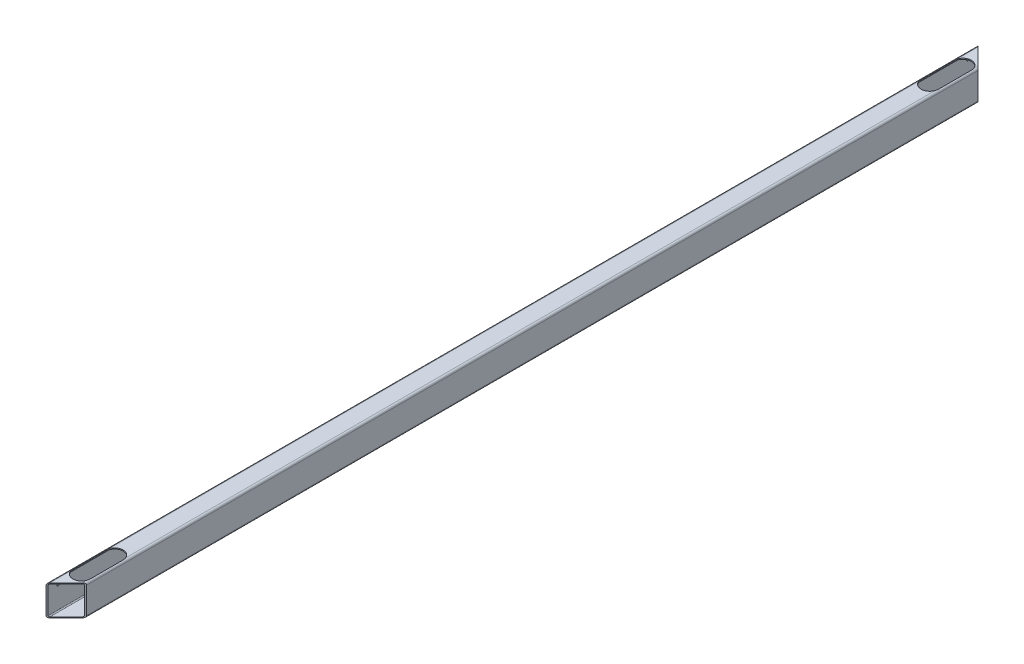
ISO-10303-21;
HEADER;
FILE_DESCRIPTION(('STEP AP214'),'2;1');
FILE_NAME('part.step','',(''),(''),'','','');
FILE_SCHEMA(('AUTOMOTIVE_DESIGN { 1 0 10303 214 1 1 1 1 }'));
ENDSEC;
DATA;
#1=APPLICATION_CONTEXT('core data for automotive mechanical design processes');
#2=APPLICATION_PROTOCOL_DEFINITION('international standard','automotive_design',2000,#1);
#3=PRODUCT_CONTEXT('',#1,'mechanical');
#4=PRODUCT('Part','Part','',(#3));
#5=PRODUCT_RELATED_PRODUCT_CATEGORY('part','',(#4));
#6=PRODUCT_DEFINITION_FORMATION('','',#4);
#7=PRODUCT_DEFINITION_CONTEXT('part definition',#1,'design');
#8=PRODUCT_DEFINITION('design','',#6,#7);
#9=PRODUCT_DEFINITION_SHAPE('','',#8);
#10=(LENGTH_UNIT() NAMED_UNIT(*) SI_UNIT(.MILLI.,.METRE.));
#11=(NAMED_UNIT(*) PLANE_ANGLE_UNIT() SI_UNIT($,.RADIAN.));
#12=(NAMED_UNIT(*) SI_UNIT($,.STERADIAN.) SOLID_ANGLE_UNIT());
#13=UNCERTAINTY_MEASURE_WITH_UNIT(LENGTH_MEASURE(1.E-05),#10,'distance_accuracy_value','');
#14=(GEOMETRIC_REPRESENTATION_CONTEXT(3) GLOBAL_UNCERTAINTY_ASSIGNED_CONTEXT((#13)) GLOBAL_UNIT_ASSIGNED_CONTEXT((#10,
#11,#12)) REPRESENTATION_CONTEXT('',''));
#15=CARTESIAN_POINT('',(0.,0.,0.));
#16=DIRECTION('',(0.,0.,1.));
#17=DIRECTION('',(1.,0.,0.));
#18=AXIS2_PLACEMENT_3D('',#15,#16,#17);
#19=CARTESIAN_POINT('',(16.,30.,918.));
#20=DIRECTION('',(0.,-1.,0.));
#21=DIRECTION('',(1.,0.,0.));
#22=AXIS2_PLACEMENT_3D('',#19,#20,#21);
#23=PLANE('',#22);
#24=DIRECTION('',(0.,0.,-1.));
#25=VECTOR('',#24,1.);
#26=CARTESIAN_POINT('',(-16.,30.,918.));
#27=LINE('',#26,#25);
#28=CARTESIAN_POINT('',(-16.,30.,797.255437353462));
#29=VERTEX_POINT('',#28);
#30=CARTESIAN_POINT('',(-16.,30.,-797.255437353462));
#31=VERTEX_POINT('',#30);
#32=EDGE_CURVE('E520',#29,#31,#27,.T.);
#33=ORIENTED_EDGE('',*,*,#32,.F.);
#34=CARTESIAN_POINT('',(0.,30.,803.));
#35=DIRECTION('',(0.,1.,0.));
#36=DIRECTION('',(-1.,0.,0.));
#37=AXIS2_PLACEMENT_3D('',#34,#35,#36);
#38=CIRCLE('',#37,17.);
#39=CARTESIAN_POINT('',(16.,30.,797.255437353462));
#40=VERTEX_POINT('',#39);
#41=EDGE_CURVE('E826',#40,#29,#38,.T.);
#42=ORIENTED_EDGE('',*,*,#41,.F.);
#43=DIRECTION('',(0.,0.,-1.));
#44=VECTOR('',#43,1.);
#45=CARTESIAN_POINT('',(16.,30.,918.));
#46=LINE('',#45,#44);
#47=CARTESIAN_POINT('',(16.,30.,-797.255437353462));
#48=VERTEX_POINT('',#47);
#49=EDGE_CURVE('E525',#40,#48,#46,.T.);
#50=ORIENTED_EDGE('',*,*,#49,.T.);
#51=CARTESIAN_POINT('',(0.,30.,-803.));
#52=DIRECTION('',(0.,1.,0.));
#53=DIRECTION('',(-1.,0.,0.));
#54=AXIS2_PLACEMENT_3D('',#51,#52,#53);
#55=CIRCLE('',#54,17.0000000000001);
#56=EDGE_CURVE('E322',#31,#48,#55,.T.);
#57=ORIENTED_EDGE('',*,*,#56,.F.);
#58=EDGE_LOOP('',(#33,#42,#50,#57));
#59=FACE_BOUND('',#58,.T.);
#60=ADVANCED_FACE('F28',(#59),#23,.F.);
#61=CARTESIAN_POINT('',(16.,28.,918.));
#62=DIRECTION('',(0.,-1.,0.));
#63=DIRECTION('',(1.,0.,0.));
#64=AXIS2_PLACEMENT_3D('',#61,#62,#63);
#65=PLANE('',#64);
#66=CARTESIAN_POINT('',(0.,28.,803.));
#67=DIRECTION('',(0.,1.,0.));
#68=DIRECTION('',(-1.,0.,0.));
#69=AXIS2_PLACEMENT_3D('',#66,#67,#68);
#70=CIRCLE('',#69,17.);
#71=CARTESIAN_POINT('',(16.,28.,797.255437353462));
#72=VERTEX_POINT('',#71);
#73=CARTESIAN_POINT('',(-16.,28.,797.255437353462));
#74=VERTEX_POINT('',#73);
#75=EDGE_CURVE('E245',#72,#74,#70,.T.);
#76=ORIENTED_EDGE('',*,*,#75,.T.);
#77=DIRECTION('',(0.,0.,-1.));
#78=VECTOR('',#77,1.);
#79=CARTESIAN_POINT('',(-16.,28.,918.));
#80=LINE('',#79,#78);
#81=CARTESIAN_POINT('',(-16.,28.,-797.255437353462));
#82=VERTEX_POINT('',#81);
#83=EDGE_CURVE('E490',#74,#82,#80,.T.);
#84=ORIENTED_EDGE('',*,*,#83,.T.);
#85=CARTESIAN_POINT('',(0.,28.,-803.));
#86=DIRECTION('',(0.,1.,0.));
#87=DIRECTION('',(-1.,0.,0.));
#88=AXIS2_PLACEMENT_3D('',#85,#86,#87);
#89=CIRCLE('',#88,17.0000000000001);
#90=CARTESIAN_POINT('',(16.,28.,-797.255437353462));
#91=VERTEX_POINT('',#90);
#92=EDGE_CURVE('E338',#82,#91,#89,.T.);
#93=ORIENTED_EDGE('',*,*,#92,.T.);
#94=DIRECTION('',(0.,0.,-1.));
#95=VECTOR('',#94,1.);
#96=CARTESIAN_POINT('',(16.,28.,918.));
#97=LINE('',#96,#95);
#98=EDGE_CURVE('E496',#72,#91,#97,.T.);
#99=ORIENTED_EDGE('',*,*,#98,.F.);
#100=EDGE_LOOP('',(#76,#84,#93,#99));
#101=FACE_BOUND('',#100,.T.);
#102=ADVANCED_FACE('F595',(#101),#65,.T.);
#103=CARTESIAN_POINT('',(-16.,30.,-873.744562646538));
#104=VERTEX_POINT('',#103);
#105=CARTESIAN_POINT('',(-16.,30.,-913.999999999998));
#106=VERTEX_POINT('',#105);
#107=EDGE_CURVE('E515',#104,#106,#27,.T.);
#108=ORIENTED_EDGE('',*,*,#107,.F.);
#109=CARTESIAN_POINT('',(0.,30.,-868.));
#110=DIRECTION('',(0.,1.,0.));
#111=DIRECTION('',(-1.,0.,0.));
#112=AXIS2_PLACEMENT_3D('',#109,#110,#111);
#113=CIRCLE('',#112,17.0000000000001);
#114=CARTESIAN_POINT('',(16.,30.,-873.744562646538));
#115=VERTEX_POINT('',#114);
#116=EDGE_CURVE('E320',#115,#104,#113,.T.);
#117=ORIENTED_EDGE('',*,*,#116,.F.);
#118=CARTESIAN_POINT('',(15.9999999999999,30.,-881.999999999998));
#119=VERTEX_POINT('',#118);
#120=EDGE_CURVE('E519',#115,#119,#46,.T.);
#121=ORIENTED_EDGE('',*,*,#120,.T.);
#122=DIRECTION('',(0.707106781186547,0.,0.707106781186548));
#123=VECTOR('',#122,1.);
#124=CARTESIAN_POINT('',(-20.0000000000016,30.,-918.));
#125=LINE('',#124,#123);
#126=EDGE_CURVE('E431',#106,#119,#125,.T.);
#127=ORIENTED_EDGE('',*,*,#126,.F.);
#128=EDGE_LOOP('',(#108,#117,#121,#127));
#129=FACE_BOUND('',#128,.T.);
#130=ADVANCED_FACE('F626',(#129),#23,.F.);
#131=CARTESIAN_POINT('',(0.,28.,-868.));
#132=DIRECTION('',(0.,1.,0.));
#133=DIRECTION('',(-1.,0.,0.));
#134=AXIS2_PLACEMENT_3D('',#131,#132,#133);
#135=CIRCLE('',#134,17.0000000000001);
#136=CARTESIAN_POINT('',(16.,28.,-873.744562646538));
#137=VERTEX_POINT('',#136);
#138=CARTESIAN_POINT('',(-16.,28.,-873.744562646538));
#139=VERTEX_POINT('',#138);
#140=EDGE_CURVE('E330',#137,#139,#135,.T.);
#141=ORIENTED_EDGE('',*,*,#140,.T.);
#142=CARTESIAN_POINT('',(-16.,28.,-913.999999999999));
#143=VERTEX_POINT('',#142);
#144=EDGE_CURVE('E485',#139,#143,#80,.T.);
#145=ORIENTED_EDGE('',*,*,#144,.T.);
#146=DIRECTION('',(-0.707106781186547,0.,-0.707106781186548));
#147=VECTOR('',#146,1.);
#148=CARTESIAN_POINT('',(915.999999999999,28.0000000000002,18.0000000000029));
#149=LINE('',#148,#147);
#150=CARTESIAN_POINT('',(16.,28.,-881.999999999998));
#151=VERTEX_POINT('',#150);
#152=EDGE_CURVE('E455',#151,#143,#149,.T.);
#153=ORIENTED_EDGE('',*,*,#152,.F.);
#154=EDGE_CURVE('E489',#137,#151,#97,.T.);
#155=ORIENTED_EDGE('',*,*,#154,.F.);
#156=EDGE_LOOP('',(#141,#145,#153,#155));
#157=FACE_BOUND('',#156,.T.);
#158=ADVANCED_FACE('F609',(#157),#65,.T.);
#159=CARTESIAN_POINT('',(16.,26.,918.));
#160=DIRECTION('',(0.,0.,-1.));
#161=DIRECTION('',(-1.,0.,0.));
#162=AXIS2_PLACEMENT_3D('',#159,#160,#161);
#163=CYLINDRICAL_SURFACE('',#162,3.99999999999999);
#164=ORIENTED_EDGE('',*,*,#49,.F.);
#165=CARTESIAN_POINT('',(12.5358983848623,28.,791.517349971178));
#166=CARTESIAN_POINT('',(12.593518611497,28.0998060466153,791.580236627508));
#167=CARTESIAN_POINT('',(12.6541995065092,28.1949476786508,791.647450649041));
#168=CARTESIAN_POINT('',(12.7801010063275,28.3757842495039,791.789385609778));
#169=CARTESIAN_POINT('',(12.8453112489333,28.4614996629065,791.864089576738));
#170=CARTESIAN_POINT('',(12.9780635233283,28.6227212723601,792.019099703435));
#171=CARTESIAN_POINT('',(13.0455626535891,28.6983487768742,792.099317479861));
#172=CARTESIAN_POINT('',(13.1825987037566,28.8411348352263,792.265443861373));
#173=CARTESIAN_POINT('',(13.2521369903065,28.9082875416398,792.351356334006));
#174=CARTESIAN_POINT('',(13.418183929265,29.0579293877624,792.560834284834));
#175=CARTESIAN_POINT('',(13.5151455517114,29.1368910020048,792.686563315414));
#176=CARTESIAN_POINT('',(13.708981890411,29.2811337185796,792.945646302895));
#177=CARTESIAN_POINT('',(13.8058565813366,29.3464116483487,793.079002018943));
#178=CARTESIAN_POINT('',(13.9985859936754,29.465144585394,793.352835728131));
#179=CARTESIAN_POINT('',(14.0944316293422,29.5185293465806,793.493350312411));
#180=CARTESIAN_POINT('',(14.2834547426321,29.6145129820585,793.77978222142));
#181=CARTESIAN_POINT('',(14.3766311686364,29.6571076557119,793.925701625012));
#182=CARTESIAN_POINT('',(14.6221389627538,29.7589064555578,794.323652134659));
#183=CARTESIAN_POINT('',(14.7712594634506,29.8094946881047,794.57988525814));
#184=CARTESIAN_POINT('',(15.0570798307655,29.8901085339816,795.102327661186));
#185=CARTESIAN_POINT('',(15.1937713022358,29.920120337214,795.368543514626));
#186=CARTESIAN_POINT('',(15.4537384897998,29.9647240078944,795.909698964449));
#187=CARTESIAN_POINT('',(15.5769695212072,29.9792658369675,796.184663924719));
#188=CARTESIAN_POINT('',(15.8087246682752,29.9971135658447,796.741002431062));
#189=CARTESIAN_POINT('',(15.917249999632,30.0004203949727,797.022375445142));
#190=CARTESIAN_POINT('',(16.0996889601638,29.999585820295,797.535640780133));
#191=CARTESIAN_POINT('',(16.1762408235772,29.9967582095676,797.766607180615));
#192=CARTESIAN_POINT('',(16.3193546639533,29.9878761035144,798.231579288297));
#193=CARTESIAN_POINT('',(16.3859155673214,29.9818212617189,798.465585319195));
#194=CARTESIAN_POINT('',(16.508954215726,29.9679716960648,798.936301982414));
#195=CARTESIAN_POINT('',(16.5654269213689,29.9601761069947,799.173013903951));
#196=CARTESIAN_POINT('',(16.6681583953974,29.9441434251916,799.648629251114));
#197=CARTESIAN_POINT('',(16.7144171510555,29.9359063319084,799.887532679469));
#198=CARTESIAN_POINT('',(16.7961727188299,29.9201816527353,800.364391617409));
#199=CARTESIAN_POINT('',(16.8317862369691,29.9126865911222,800.602326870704));
#200=CARTESIAN_POINT('',(16.892888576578,29.8991951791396,801.079535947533));
#201=CARTESIAN_POINT('',(16.9183774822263,29.8931988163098,801.318809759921));
#202=CARTESIAN_POINT('',(16.9591692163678,29.883356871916,801.798165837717));
#203=CARTESIAN_POINT('',(16.9744764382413,29.8795103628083,802.038247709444));
#204=CARTESIAN_POINT('',(16.9948940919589,29.8743002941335,802.518885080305));
#205=CARTESIAN_POINT('',(17.0000039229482,29.8729368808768,802.759440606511));
#206=CARTESIAN_POINT('',(17.,29.8729833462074,803.));
#207=B_SPLINE_CURVE_WITH_KNOTS('',3,(#165,#166,#167,#168,#169,#170,#171,#172,#173,#174,#175,
#176,#177,#178,#179,#180,#181,#182,#183,#184,#185,#186,#187,#188,#189,#190,#191,#192,#193,#194,
#195,#196,#197,#198,#199,#200,#201,#202,#203,#204,#205,#206),.UNSPECIFIED.,.F.,.F.,(4,2,2,2,2,2,
2,2,2,2,2,2,2,2,2,2,2,2,2,2,4),(0.,0.393482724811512,0.786093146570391,1.17344774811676,
1.56106817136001,2.09220738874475,2.62346961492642,3.15779107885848,3.69232023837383,
4.59308998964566,5.49446371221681,6.3987441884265,7.3029498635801,8.0327229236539,
8.76257434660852,9.49278934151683,10.2230052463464,10.9448943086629,11.6667773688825,
12.3883487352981,13.1099626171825),.UNSPECIFIED.);
#208=CARTESIAN_POINT('',(17.,29.8729833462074,803.));
#209=VERTEX_POINT('',#208);
#210=EDGE_CURVE('E314',#40,#209,#207,.T.);
#211=ORIENTED_EDGE('',*,*,#210,.T.);
#212=DIRECTION('',(0.,0.,-1.));
#213=VECTOR('',#212,1.);
#214=CARTESIAN_POINT('',(17.,29.8729833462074,918.));
#215=LINE('',#214,#213);
#216=CARTESIAN_POINT('',(17.,29.8729833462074,868.));
#217=VERTEX_POINT('',#216);
#218=EDGE_CURVE('E11',#209,#217,#215,.F.);
#219=ORIENTED_EDGE('',*,*,#218,.T.);
#220=CARTESIAN_POINT('',(15.9999999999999,30.,862.255437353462));
#221=CARTESIAN_POINT('',(16.0810210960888,29.9999652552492,862.481090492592));
#222=CARTESIAN_POINT('',(16.1572536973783,29.9975381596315,862.708436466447));
#223=CARTESIAN_POINT('',(16.3000171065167,29.9893826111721,863.16607233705));
#224=CARTESIAN_POINT('',(16.3665489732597,29.9836545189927,863.396361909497));
#225=CARTESIAN_POINT('',(16.4898145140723,29.9703785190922,863.859532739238));
#226=CARTESIAN_POINT('',(16.5465464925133,29.9628302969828,864.09241443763));
#227=CARTESIAN_POINT('',(16.6501130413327,29.9471637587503,864.560355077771));
#228=CARTESIAN_POINT('',(16.6969473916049,29.9390454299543,864.795414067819));
#229=CARTESIAN_POINT('',(16.7794465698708,29.9235408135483,865.260589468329));
#230=CARTESIAN_POINT('',(16.8153917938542,29.9161402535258,865.490655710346));
#231=CARTESIAN_POINT('',(16.8778061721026,29.902624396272,865.952107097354));
#232=CARTESIAN_POINT('',(16.9042754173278,29.8965090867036,866.183492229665));
#233=CARTESIAN_POINT('',(16.9476838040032,29.8861798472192,866.647145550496));
#234=CARTESIAN_POINT('',(16.9646251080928,29.8819654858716,866.87941352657));
#235=CARTESIAN_POINT('',(16.9889528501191,29.8758391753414,867.344482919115));
#236=CARTESIAN_POINT('',(16.9963391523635,29.8739272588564,867.577284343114));
#237=CARTESIAN_POINT('',(17.0017117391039,29.8725424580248,868.0583388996));
#238=CARTESIAN_POINT('',(16.9990470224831,29.8732384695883,868.306600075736));
#239=CARTESIAN_POINT('',(16.9828504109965,29.8773797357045,868.802745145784));
#240=CARTESIAN_POINT('',(16.969318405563,29.8808250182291,869.050629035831));
#241=CARTESIAN_POINT('',(16.9314124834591,29.890096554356,869.545607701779));
#242=CARTESIAN_POINT('',(16.9070347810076,29.8959236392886,869.792702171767));
#243=CARTESIAN_POINT('',(16.8474898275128,29.9093081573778,870.285541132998));
#244=CARTESIAN_POINT('',(16.812322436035,29.916865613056,870.531285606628));
#245=CARTESIAN_POINT('',(16.7300004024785,29.933054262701,871.028627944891));
#246=CARTESIAN_POINT('',(16.6825054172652,29.9417116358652,871.280168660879));
#247=CARTESIAN_POINT('',(16.5762066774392,29.9586455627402,871.780856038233));
#248=CARTESIAN_POINT('',(16.5174031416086,29.9669221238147,872.030002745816));
#249=CARTESIAN_POINT('',(16.3886090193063,29.9816086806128,872.525367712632));
#250=CARTESIAN_POINT('',(16.318621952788,29.9880192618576,872.771586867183));
#251=CARTESIAN_POINT('',(16.167578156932,29.9971926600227,873.260701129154));
#252=CARTESIAN_POINT('',(16.0865201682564,29.9999550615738,873.50359585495));
#253=CARTESIAN_POINT('',(15.9999999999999,30.,873.744562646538));
#254=B_SPLINE_CURVE_WITH_KNOTS('',3,(#220,#221,#222,#223,#224,#225,#226,#227,#228,#229,#230,
#231,#232,#233,#234,#235,#236,#237,#238,#239,#240,#241,#242,#243,#244,#245,#246,#247,#248,#249,
#250,#251,#252,#253),.UNSPECIFIED.,.F.,.F.,(4,2,2,2,2,2,2,2,2,2,2,2,2,2,2,2,4),(0.,
0.719173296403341,1.4382680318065,2.15748706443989,2.87672208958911,3.5754499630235,
4.27417112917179,4.97273363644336,5.67130606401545,6.415878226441,7.16045796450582,
7.9052978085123,8.65014734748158,9.41827988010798,10.1863975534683,10.9542739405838,
11.722237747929),.UNSPECIFIED.);
#255=CARTESIAN_POINT('',(16.,30.,873.744562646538));
#256=VERTEX_POINT('',#255);
#257=EDGE_CURVE('E285',#217,#256,#254,.T.);
#258=ORIENTED_EDGE('',*,*,#257,.T.);
#259=CARTESIAN_POINT('',(16.,30.,882.));
#260=VERTEX_POINT('',#259);
#261=EDGE_CURVE('E521',#260,#256,#46,.T.);
#262=ORIENTED_EDGE('',*,*,#261,.F.);
#263=CARTESIAN_POINT('',(16.,26.,882.));
#264=DIRECTION('',(-0.707106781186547,0.,-0.707106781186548));
#265=DIRECTION('',(0.707106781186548,0.,-0.707106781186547));
#266=AXIS2_PLACEMENT_3D('',#263,#264,#265);
#267=ELLIPSE('',#266,5.65685424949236,3.99999999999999);
#268=CARTESIAN_POINT('',(20.,26.,878.));
#269=VERTEX_POINT('',#268);
#270=EDGE_CURVE('E428',#260,#269,#267,.T.);
#271=ORIENTED_EDGE('',*,*,#270,.T.);
#272=DIRECTION('',(0.,0.,-1.));
#273=VECTOR('',#272,1.);
#274=CARTESIAN_POINT('',(20.,26.,918.));
#275=LINE('',#274,#273);
#276=CARTESIAN_POINT('',(20.,26.,-877.999999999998));
#277=VERTEX_POINT('',#276);
#278=EDGE_CURVE('E501',#269,#277,#275,.T.);
#279=ORIENTED_EDGE('',*,*,#278,.T.);
#280=CARTESIAN_POINT('',(16.,26.,-881.999999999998));
#281=DIRECTION('',(-0.707106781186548,0.,0.707106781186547));
#282=DIRECTION('',(-0.707106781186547,0.,-0.707106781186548));
#283=AXIS2_PLACEMENT_3D('',#280,#281,#282);
#284=ELLIPSE('',#283,5.65685424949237,3.99999999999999);
#285=EDGE_CURVE('E470',#277,#119,#284,.T.);
#286=ORIENTED_EDGE('',*,*,#285,.T.);
#287=ORIENTED_EDGE('',*,*,#120,.F.);
#288=CARTESIAN_POINT('',(12.5358983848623,28.,-879.482650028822));
#289=CARTESIAN_POINT('',(12.593518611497,28.0998060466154,-879.419763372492));
#290=CARTESIAN_POINT('',(12.6541995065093,28.1949476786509,-879.352549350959));
#291=CARTESIAN_POINT('',(12.7801010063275,28.375784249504,-879.210614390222));
#292=CARTESIAN_POINT('',(12.8453112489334,28.4614996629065,-879.135910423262));
#293=CARTESIAN_POINT('',(12.9780635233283,28.6227212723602,-878.980900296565));
#294=CARTESIAN_POINT('',(13.0455626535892,28.6983487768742,-878.900682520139));
#295=CARTESIAN_POINT('',(13.1825987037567,28.8411348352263,-878.734556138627));
#296=CARTESIAN_POINT('',(13.2521369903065,28.9082875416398,-878.648643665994));
#297=CARTESIAN_POINT('',(13.418183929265,29.0579293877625,-878.439165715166));
#298=CARTESIAN_POINT('',(13.5151455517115,29.1368910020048,-878.313436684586));
#299=CARTESIAN_POINT('',(13.7089818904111,29.2811337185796,-878.054353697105));
#300=CARTESIAN_POINT('',(13.8058565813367,29.3464116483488,-877.920997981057));
#301=CARTESIAN_POINT('',(13.9985859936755,29.4651445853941,-877.647164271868));
#302=CARTESIAN_POINT('',(14.0944316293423,29.5185293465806,-877.506649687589));
#303=CARTESIAN_POINT('',(14.2834547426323,29.6145129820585,-877.22021777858));
#304=CARTESIAN_POINT('',(14.3766311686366,29.657107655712,-877.074298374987));
#305=CARTESIAN_POINT('',(14.6221389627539,29.7589064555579,-876.676347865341));
#306=CARTESIAN_POINT('',(14.7712594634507,29.8094946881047,-876.42011474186));
#307=CARTESIAN_POINT('',(15.0570798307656,29.8901085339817,-875.897672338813));
#308=CARTESIAN_POINT('',(15.1937713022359,29.920120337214,-875.631456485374));
#309=CARTESIAN_POINT('',(15.4537384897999,29.9647240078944,-875.090301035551));
#310=CARTESIAN_POINT('',(15.5769695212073,29.9792658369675,-874.815336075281));
#311=CARTESIAN_POINT('',(15.8087246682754,29.9971135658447,-874.258997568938));
#312=CARTESIAN_POINT('',(15.9172499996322,30.0004203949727,-873.977624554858));
#313=CARTESIAN_POINT('',(16.099688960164,29.999585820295,-873.464359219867));
#314=CARTESIAN_POINT('',(16.1762408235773,29.9967582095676,-873.233392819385));
#315=CARTESIAN_POINT('',(16.3193546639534,29.9878761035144,-872.768420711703));
#316=CARTESIAN_POINT('',(16.3859155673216,29.9818212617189,-872.534414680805));
#317=CARTESIAN_POINT('',(16.5089542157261,29.9679716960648,-872.063698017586));
#318=CARTESIAN_POINT('',(16.565426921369,29.9601761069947,-871.826986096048));
#319=CARTESIAN_POINT('',(16.6681583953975,29.9441434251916,-871.351370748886));
#320=CARTESIAN_POINT('',(16.7144171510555,29.9359063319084,-871.112467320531));
#321=CARTESIAN_POINT('',(16.7961727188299,29.9201816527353,-870.635608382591));
#322=CARTESIAN_POINT('',(16.8317862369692,29.9126865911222,-870.397673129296));
#323=CARTESIAN_POINT('',(16.8928885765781,29.8991951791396,-869.920464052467));
#324=CARTESIAN_POINT('',(16.9183774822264,29.8931988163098,-869.681190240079));
#325=CARTESIAN_POINT('',(16.9591692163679,29.883356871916,-869.201834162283));
#326=CARTESIAN_POINT('',(16.9744764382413,29.8795103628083,-868.961752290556));
#327=CARTESIAN_POINT('',(16.9948940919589,29.8743002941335,-868.481114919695));
#328=CARTESIAN_POINT('',(17.0000039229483,29.8729368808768,-868.240559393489));
#329=CARTESIAN_POINT('',(17.,29.8729833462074,-868.));
#330=B_SPLINE_CURVE_WITH_KNOTS('',3,(#288,#289,#290,#291,#292,#293,#294,#295,#296,#297,#298,
#299,#300,#301,#302,#303,#304,#305,#306,#307,#308,#309,#310,#311,#312,#313,#314,#315,#316,#317,
#318,#319,#320,#321,#322,#323,#324,#325,#326,#327,#328,#329),.UNSPECIFIED.,.F.,.F.,(4,2,2,2,2,2,
2,2,2,2,2,2,2,2,2,2,2,2,2,2,4),(0.,0.393482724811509,0.786093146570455,1.17344774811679,
1.56106817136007,2.09220738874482,2.62346961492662,3.15779107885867,3.69232023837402,
4.59308998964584,5.49446371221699,6.39874418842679,7.3029498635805,8.0327229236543,
8.76257434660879,9.49278934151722,10.2230052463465,10.944894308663,11.6667773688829,
12.3883487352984,13.1099626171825),.UNSPECIFIED.);
#331=CARTESIAN_POINT('',(17.,29.8729833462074,-868.));
#332=VERTEX_POINT('',#331);
#333=EDGE_CURVE('E392',#115,#332,#330,.T.);
#334=ORIENTED_EDGE('',*,*,#333,.T.);
#335=DIRECTION('',(0.,0.,-1.));
#336=VECTOR('',#335,1.);
#337=CARTESIAN_POINT('',(17.,29.8729833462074,918.));
#338=LINE('',#337,#336);
#339=CARTESIAN_POINT('',(17.,29.8729833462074,-803.));
#340=VERTEX_POINT('',#339);
#341=EDGE_CURVE('E533',#332,#340,#338,.F.);
#342=ORIENTED_EDGE('',*,*,#341,.T.);
#343=CARTESIAN_POINT('',(15.9999999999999,30.,-808.744562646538));
#344=CARTESIAN_POINT('',(16.0810210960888,29.9999652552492,-808.518909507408));
#345=CARTESIAN_POINT('',(16.1572536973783,29.9975381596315,-808.291563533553));
#346=CARTESIAN_POINT('',(16.3000171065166,29.9893826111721,-807.83392766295));
#347=CARTESIAN_POINT('',(16.3665489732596,29.9836545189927,-807.603638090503));
#348=CARTESIAN_POINT('',(16.4898145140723,29.9703785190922,-807.140467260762));
#349=CARTESIAN_POINT('',(16.5465464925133,29.9628302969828,-806.90758556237));
#350=CARTESIAN_POINT('',(16.6501130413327,29.9471637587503,-806.439644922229));
#351=CARTESIAN_POINT('',(16.6969473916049,29.9390454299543,-806.204585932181));
#352=CARTESIAN_POINT('',(16.7794465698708,29.9235408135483,-805.739410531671));
#353=CARTESIAN_POINT('',(16.8153917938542,29.9161402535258,-805.509344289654));
#354=CARTESIAN_POINT('',(16.8778061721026,29.902624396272,-805.047892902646));
#355=CARTESIAN_POINT('',(16.9042754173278,29.8965090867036,-804.816507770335));
#356=CARTESIAN_POINT('',(16.9476838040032,29.8861798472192,-804.352854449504));
#357=CARTESIAN_POINT('',(16.9646251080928,29.8819654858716,-804.12058647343));
#358=CARTESIAN_POINT('',(16.9889528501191,29.8758391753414,-803.655517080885));
#359=CARTESIAN_POINT('',(16.9963391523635,29.8739272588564,-803.422715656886));
#360=CARTESIAN_POINT('',(17.001711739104,29.8725424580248,-802.9416611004));
#361=CARTESIAN_POINT('',(16.9990470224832,29.8732384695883,-802.693399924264));
#362=CARTESIAN_POINT('',(16.9828504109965,29.8773797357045,-802.197254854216));
#363=CARTESIAN_POINT('',(16.969318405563,29.8808250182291,-801.949370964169));
#364=CARTESIAN_POINT('',(16.9314124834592,29.890096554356,-801.454392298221));
#365=CARTESIAN_POINT('',(16.9070347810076,29.8959236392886,-801.207297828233));
#366=CARTESIAN_POINT('',(16.8474898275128,29.9093081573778,-800.714458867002));
#367=CARTESIAN_POINT('',(16.8123224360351,29.916865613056,-800.468714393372));
#368=CARTESIAN_POINT('',(16.7300004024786,29.933054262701,-799.971372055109));
#369=CARTESIAN_POINT('',(16.6825054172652,29.9417116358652,-799.719831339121));
#370=CARTESIAN_POINT('',(16.5762066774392,29.9586455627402,-799.219143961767));
#371=CARTESIAN_POINT('',(16.5174031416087,29.9669221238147,-798.969997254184));
#372=CARTESIAN_POINT('',(16.3886090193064,29.9816086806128,-798.474632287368));
#373=CARTESIAN_POINT('',(16.318621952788,29.9880192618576,-798.228413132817));
#374=CARTESIAN_POINT('',(16.1675781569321,29.9971926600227,-797.739298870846));
#375=CARTESIAN_POINT('',(16.0865201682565,29.9999550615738,-797.496404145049));
#376=CARTESIAN_POINT('',(15.9999999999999,30.,-797.255437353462));
#377=B_SPLINE_CURVE_WITH_KNOTS('',3,(#343,#344,#345,#346,#347,#348,#349,#350,#351,#352,#353,
#354,#355,#356,#357,#358,#359,#360,#361,#362,#363,#364,#365,#366,#367,#368,#369,#370,#371,#372,
#373,#374,#375,#376),.UNSPECIFIED.,.F.,.F.,(4,2,2,2,2,2,2,2,2,2,2,2,2,2,2,2,4),(0.,
0.719173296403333,1.43826803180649,2.15748706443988,2.8767220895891,3.5754499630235,
4.27417112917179,4.97273363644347,5.67130606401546,6.41587822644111,7.16045796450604,
7.90529780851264,8.65014734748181,9.41827988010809,10.1863975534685,10.9542739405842,
11.7222377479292),.UNSPECIFIED.);
#378=EDGE_CURVE('E362',#340,#48,#377,.T.);
#379=ORIENTED_EDGE('',*,*,#378,.T.);
#380=EDGE_LOOP('',(#164,#211,#219,#258,#262,#271,#279,#286,#287,#334,#342,#379));
#381=FACE_BOUND('',#380,.T.);
#382=ADVANCED_FACE('F30',(#381),#163,.T.);
#383=ORIENTED_EDGE('',*,*,#261,.T.);
#384=CARTESIAN_POINT('',(0.,30.,868.));
#385=DIRECTION('',(0.,1.,0.));
#386=DIRECTION('',(-1.,0.,0.));
#387=AXIS2_PLACEMENT_3D('',#384,#385,#386);
#388=CIRCLE('',#387,17.);
#389=CARTESIAN_POINT('',(-16.,30.,873.744562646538));
#390=VERTEX_POINT('',#389);
#391=EDGE_CURVE('E246',#390,#256,#388,.T.);
#392=ORIENTED_EDGE('',*,*,#391,.F.);
#393=CARTESIAN_POINT('',(-16.,30.,914.));
#394=VERTEX_POINT('',#393);
#395=EDGE_CURVE('E516',#394,#390,#27,.T.);
#396=ORIENTED_EDGE('',*,*,#395,.F.);
#397=DIRECTION('',(-0.707106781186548,0.,0.707106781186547));
#398=VECTOR('',#397,1.);
#399=CARTESIAN_POINT('',(-20.,30.,918.));
#400=LINE('',#399,#398);
#401=EDGE_CURVE('E398',#260,#394,#400,.T.);
#402=ORIENTED_EDGE('',*,*,#401,.F.);
#403=EDGE_LOOP('',(#383,#392,#396,#402));
#404=FACE_BOUND('',#403,.T.);
#405=ADVANCED_FACE('F655',(#404),#23,.F.);
#406=CARTESIAN_POINT('',(-16.,26.,918.));
#407=DIRECTION('',(0.,0.,-1.));
#408=DIRECTION('',(-1.,0.,0.));
#409=AXIS2_PLACEMENT_3D('',#406,#407,#408);
#410=CYLINDRICAL_SURFACE('',#409,3.99999999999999);
#411=DIRECTION('',(0.,0.,-1.));
#412=VECTOR('',#411,1.);
#413=CARTESIAN_POINT('',(-17.,29.8729833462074,918.));
#414=LINE('',#413,#412);
#415=CARTESIAN_POINT('',(-17.,29.8729833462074,868.));
#416=VERTEX_POINT('',#415);
#417=CARTESIAN_POINT('',(-17.,29.8729833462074,803.));
#418=VERTEX_POINT('',#417);
#419=EDGE_CURVE('E37',#416,#418,#414,.T.);
#420=ORIENTED_EDGE('',*,*,#419,.T.);
#421=CARTESIAN_POINT('',(-17.,29.8729833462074,803.));
#422=CARTESIAN_POINT('',(-17.0000036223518,29.8729405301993,802.764363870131));
#423=CARTESIAN_POINT('',(-16.9951009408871,29.8742469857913,802.528731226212));
#424=CARTESIAN_POINT('',(-16.9755101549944,29.8792484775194,802.057910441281));
#425=CARTESIAN_POINT('',(-16.9608225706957,29.8829433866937,801.822722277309));
#426=CARTESIAN_POINT('',(-16.9216814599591,29.8924137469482,801.353110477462));
#427=CARTESIAN_POINT('',(-16.8972240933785,29.898190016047,801.1186871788));
#428=CARTESIAN_POINT('',(-16.8385922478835,29.9112236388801,800.651100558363));
#429=CARTESIAN_POINT('',(-16.8044177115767,29.9184810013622,800.417937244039));
#430=CARTESIAN_POINT('',(-16.7261080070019,29.9337474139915,799.951445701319));
#431=CARTESIAN_POINT('',(-16.6818973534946,29.9417618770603,799.718130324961));
#432=CARTESIAN_POINT('',(-16.5837406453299,29.9574887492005,799.25354636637));
#433=CARTESIAN_POINT('',(-16.5297946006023,29.96520115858,799.02227778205));
#434=CARTESIAN_POINT('',(-16.4122780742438,29.9791363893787,798.562269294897));
#435=CARTESIAN_POINT('',(-16.3487122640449,29.9853599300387,798.333528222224));
#436=CARTESIAN_POINT('',(-16.2120460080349,29.9949627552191,797.878876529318));
#437=CARTESIAN_POINT('',(-16.138946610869,29.9983423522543,797.652965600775));
#438=CARTESIAN_POINT('',(-15.9721740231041,30.000893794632,797.172192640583));
#439=CARTESIAN_POINT('',(-15.8770537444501,29.9993926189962,796.917825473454));
#440=CARTESIAN_POINT('',(-15.6747983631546,29.9880452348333,796.414079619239));
#441=CARTESIAN_POINT('',(-15.5676635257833,29.9781992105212,796.164700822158));
#442=CARTESIAN_POINT('',(-15.3421956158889,29.9471773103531,795.672650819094));
#443=CARTESIAN_POINT('',(-15.2238973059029,29.926035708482,795.429961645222));
#444=CARTESIAN_POINT('',(-14.9766399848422,29.8689584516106,794.95185832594));
#445=CARTESIAN_POINT('',(-14.8476847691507,29.8330280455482,794.716441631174));
#446=CARTESIAN_POINT('',(-14.6240460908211,29.7570964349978,794.329957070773));
#447=CARTESIAN_POINT('',(-14.5318939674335,29.7222403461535,794.176409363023));
#448=CARTESIAN_POINT('',(-14.3440233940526,29.6425480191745,793.874178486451));
#449=CARTESIAN_POINT('',(-14.2483059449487,29.5977145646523,793.725493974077));
#450=CARTESIAN_POINT('',(-14.0541810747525,29.4965364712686,793.433878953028));
#451=CARTESIAN_POINT('',(-13.9557737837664,29.4401923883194,793.290948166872));
#452=CARTESIAN_POINT('',(-13.7575335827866,29.3143813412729,793.012031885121));
#453=CARTESIAN_POINT('',(-13.6577012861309,29.2449198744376,792.876043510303));
#454=CARTESIAN_POINT('',(-13.4873552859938,29.1136084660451,792.650846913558));
#455=CARTESIAN_POINT('',(-13.4167732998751,29.0554364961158,792.559552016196));
#456=CARTESIAN_POINT('',(-13.2765439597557,28.9311416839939,792.381796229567));
#457=CARTESIAN_POINT('',(-13.2068968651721,28.8650166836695,792.295336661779));
#458=CARTESIAN_POINT('',(-13.0012025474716,28.6543398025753,792.044869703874));
#459=CARTESIAN_POINT('',(-12.8677089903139,28.4969754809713,791.888866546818));
#460=CARTESIAN_POINT('',(-12.706829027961,28.2713237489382,791.706658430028));
#461=CARTESIAN_POINT('',(-12.6714305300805,28.2191671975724,791.666970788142));
#462=CARTESIAN_POINT('',(-12.6023247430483,28.1118409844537,791.590177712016));
#463=CARTESIAN_POINT('',(-12.5686187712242,28.0566690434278,791.553074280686));
#464=CARTESIAN_POINT('',(-12.5358983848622,28.,791.517349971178));
#465=B_SPLINE_CURVE_WITH_KNOTS('',3,(#421,#422,#423,#424,#425,#426,#427,#428,#429,#430,#431,
#432,#433,#434,#435,#436,#437,#438,#439,#440,#441,#442,#443,#444,#445,#446,#447,#448,#449,#450,
#451,#452,#453,#454,#455,#456,#457,#458,#459,#460,#461,#462,#463,#464),.UNSPECIFIED.,.F.,.F.,(4,
2,2,2,2,2,2,2,2,2,2,2,2,2,2,2,2,2,2,2,2,4),(0.,0.706848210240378,1.41365885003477,
2.12074758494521,2.82784049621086,3.54043909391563,4.25303696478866,4.96528989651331,
5.6774645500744,6.4917833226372,7.30608411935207,8.11792801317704,8.92948401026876,
9.47648764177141,10.023338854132,10.5701636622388,11.116759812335,11.5041157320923,
11.8915770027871,12.6627802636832,12.8861532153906,13.1096974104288),.UNSPECIFIED.);
#466=EDGE_CURVE('E251',#418,#29,#465,.T.);
#467=ORIENTED_EDGE('',*,*,#466,.T.);
#468=ORIENTED_EDGE('',*,*,#32,.T.);
#469=CARTESIAN_POINT('',(-15.,22.1270166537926,-811.));
#470=CARTESIAN_POINT('',(-15.0792032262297,22.1065847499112,-810.851505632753));
#471=CARTESIAN_POINT('',(-15.1563532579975,22.0892372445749,-810.701527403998));
#472=CARTESIAN_POINT('',(-15.3063291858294,22.0598612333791,-810.398968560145));
#473=CARTESIAN_POINT('',(-15.3791564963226,22.0478309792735,-810.246388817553));
#474=CARTESIAN_POINT('',(-15.5202159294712,22.0282420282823,-809.939124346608));
#475=CARTESIAN_POINT('',(-15.5884547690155,22.0206766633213,-809.784443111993));
#476=CARTESIAN_POINT('',(-15.7203359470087,22.0092399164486,-809.472993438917));
#477=CARTESIAN_POINT('',(-15.7839778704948,22.005368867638,-809.316224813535));
#478=CARTESIAN_POINT('',(-15.9677000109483,21.9982496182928,-808.843519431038));
#479=CARTESIAN_POINT('',(-16.0807708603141,21.9994723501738,-808.524760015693));
#480=CARTESIAN_POINT('',(-16.2877091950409,22.0090182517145,-807.881079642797));
#481=CARTESIAN_POINT('',(-16.381567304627,22.017344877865,-807.556155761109));
#482=CARTESIAN_POINT('',(-16.5649100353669,22.0388257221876,-806.842257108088));
#483=CARTESIAN_POINT('',(-16.6505480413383,22.0525800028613,-806.4523062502));
#484=CARTESIAN_POINT('',(-16.7941777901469,22.0789533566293,-805.667359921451));
#485=CARTESIAN_POINT('',(-16.8521715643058,22.0915725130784,-805.272364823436));
#486=CARTESIAN_POINT('',(-16.9402555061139,22.1118125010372,-804.478884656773));
#487=CARTESIAN_POINT('',(-16.9703313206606,22.1194307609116,-804.080397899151));
#488=CARTESIAN_POINT('',(-16.9943447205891,22.1255577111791,-803.481833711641));
#489=CARTESIAN_POINT('',(-16.9988318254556,22.1267164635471,-803.282152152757));
#490=CARTESIAN_POINT('',(-17.0007682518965,22.1272135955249,-802.882755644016));
#491=CARTESIAN_POINT('',(-16.9982179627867,22.126552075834,-802.683040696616));
#492=CARTESIAN_POINT('',(-16.9849650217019,22.1231584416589,-802.247087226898));
#493=CARTESIAN_POINT('',(-16.9728479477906,22.1200675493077,-802.010893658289));
#494=CARTESIAN_POINT('',(-16.9387755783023,22.1116832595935,-801.539251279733));
#495=CARTESIAN_POINT('',(-16.9168199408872,22.106389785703,-801.303802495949));
#496=CARTESIAN_POINT('',(-16.863104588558,22.0941314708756,-800.83398326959));
#497=CARTESIAN_POINT('',(-16.8313412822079,22.0871660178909,-800.599613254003));
#498=CARTESIAN_POINT('',(-16.7580720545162,22.072313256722,-800.132435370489));
#499=CARTESIAN_POINT('',(-16.7165662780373,22.0644259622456,-799.899627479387));
#500=CARTESIAN_POINT('',(-16.6238869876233,22.0486744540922,-799.435976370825));
#501=CARTESIAN_POINT('',(-16.5727147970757,22.0408102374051,-799.205132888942));
#502=CARTESIAN_POINT('',(-16.4607783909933,22.0262274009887,-798.745747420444));
#503=CARTESIAN_POINT('',(-16.4000142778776,22.0195087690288,-798.517205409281));
#504=CARTESIAN_POINT('',(-16.2690231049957,22.0085160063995,-798.062922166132));
#505=CARTESIAN_POINT('',(-16.1988013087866,22.0042405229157,-797.837179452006));
#506=CARTESIAN_POINT('',(-16.0489991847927,21.9995982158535,-797.388807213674));
#507=CARTESIAN_POINT('',(-15.9694201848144,21.999230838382,-797.166177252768));
#508=CARTESIAN_POINT('',(-15.7985026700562,22.0041356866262,-796.717753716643));
#509=CARTESIAN_POINT('',(-15.7068802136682,22.0095796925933,-796.492069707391));
#510=CARTESIAN_POINT('',(-15.514147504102,22.0284354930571,-796.045113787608));
#511=CARTESIAN_POINT('',(-15.413037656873,22.0418469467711,-795.82384168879));
#512=CARTESIAN_POINT('',(-15.2018659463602,22.0789711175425,-795.386713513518));
#513=CARTESIAN_POINT('',(-15.0918124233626,22.1026743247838,-795.170852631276));
#514=CARTESIAN_POINT('',(-14.8633869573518,22.1630648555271,-794.745427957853));
#515=CARTESIAN_POINT('',(-14.7450170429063,22.1997490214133,-794.535862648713));
#516=CARTESIAN_POINT('',(-14.5313560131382,22.2780901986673,-794.175485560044));
#517=CARTESIAN_POINT('',(-14.4376225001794,22.3162571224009,-794.022993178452));
#518=CARTESIAN_POINT('',(-14.2468039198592,22.403154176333,-793.723139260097));
#519=CARTESIAN_POINT('',(-14.1497185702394,22.4518851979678,-793.575778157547));
#520=CARTESIAN_POINT('',(-13.9533466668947,22.5614203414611,-793.287405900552));
#521=CARTESIAN_POINT('',(-13.8540634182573,22.6222073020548,-793.146386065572));
#522=CARTESIAN_POINT('',(-13.6546272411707,22.7575101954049,-792.871823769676));
#523=CARTESIAN_POINT('',(-13.5544747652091,22.832019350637,-792.738277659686));
#524=CARTESIAN_POINT('',(-13.3239145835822,23.0221901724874,-792.439745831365));
#525=CARTESIAN_POINT('',(-13.1938303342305,23.1434360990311,-792.277973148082));
#526=CARTESIAN_POINT('',(-12.9413825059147,23.4155831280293,-791.974598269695));
#527=CARTESIAN_POINT('',(-12.8190085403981,23.5664431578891,-791.832968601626));
#528=CARTESIAN_POINT('',(-12.6122636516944,23.8670055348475,-791.600430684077));
#529=CARTESIAN_POINT('',(-12.5251276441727,24.0112435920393,-791.505013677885));
#530=CARTESIAN_POINT('',(-12.4060287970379,24.2419074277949,-791.377011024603));
#531=CARTESIAN_POINT('',(-12.3682497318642,24.3212167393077,-791.336850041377));
#532=CARTESIAN_POINT('',(-12.2972251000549,24.4842972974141,-791.261988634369));
#533=CARTESIAN_POINT('',(-12.2639774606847,24.5680664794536,-791.227285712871));
#534=CARTESIAN_POINT('',(-12.2023838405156,24.7404118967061,-791.163454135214));
#535=CARTESIAN_POINT('',(-12.1740848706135,24.8290247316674,-791.134378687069));
#536=CARTESIAN_POINT('',(-12.1233930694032,25.0096900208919,-791.082590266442));
#537=CARTESIAN_POINT('',(-12.100997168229,25.1017406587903,-791.059873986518));
#538=CARTESIAN_POINT('',(-12.0626309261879,25.2885154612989,-791.021115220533));
#539=CARTESIAN_POINT('',(-12.0466581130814,25.3832385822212,-791.005070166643));
#540=CARTESIAN_POINT('',(-12.0215286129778,25.5744859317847,-790.979884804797));
#541=CARTESIAN_POINT('',(-12.0123708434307,25.671009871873,-790.970743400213));
#542=CARTESIAN_POINT('',(-12.0018927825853,25.8512895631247,-790.960290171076));
#543=CARTESIAN_POINT('',(-11.9996547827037,25.9349411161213,-790.958061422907));
#544=CARTESIAN_POINT('',(-12.0004315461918,26.1022241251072,-790.958835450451));
#545=CARTESIAN_POINT('',(-12.0034479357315,26.1858555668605,-790.961839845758));
#546=CARTESIAN_POINT('',(-12.0146777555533,26.35236606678,-790.973047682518));
#547=CARTESIAN_POINT('',(-12.0228878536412,26.4352455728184,-790.981247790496));
#548=CARTESIAN_POINT('',(-12.044338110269,26.599692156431,-791.00274433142));
#549=CARTESIAN_POINT('',(-12.0575801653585,26.6812587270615,-791.016042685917));
#550=CARTESIAN_POINT('',(-12.103229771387,26.9164571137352,-791.062090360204));
#551=CARTESIAN_POINT('',(-12.1420798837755,27.0676282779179,-791.101496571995));
#552=CARTESIAN_POINT('',(-12.2349850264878,27.3594812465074,-791.197053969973));
#553=CARTESIAN_POINT('',(-12.2890424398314,27.5001614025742,-791.253207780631));
#554=CARTESIAN_POINT('',(-12.4145979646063,27.7805851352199,-791.38592314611));
#555=CARTESIAN_POINT('',(-12.4872015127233,27.9191910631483,-791.463831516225));
#556=CARTESIAN_POINT('',(-12.6429405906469,28.1802055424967,-791.634728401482));
#557=CARTESIAN_POINT('',(-12.7260823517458,28.302604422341,-791.72772584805));
#558=CARTESIAN_POINT('',(-12.8801605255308,28.5058113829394,-791.904414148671));
#559=CARTESIAN_POINT('',(-12.949746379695,28.5898394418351,-791.985636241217));
#560=CARTESIAN_POINT('',(-13.0917115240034,28.7483040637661,-792.154755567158));
#561=CARTESIAN_POINT('',(-13.1640920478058,28.8227363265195,-792.242655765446));
#562=CARTESIAN_POINT('',(-13.3837680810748,29.0325607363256,-792.515300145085));
#563=CARTESIAN_POINT('',(-13.5334267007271,29.1542649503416,-792.708794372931));
#564=CARTESIAN_POINT('',(-13.7972615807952,29.3418309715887,-793.066552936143));
#565=CARTESIAN_POINT('',(-13.9117374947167,29.4140982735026,-793.227404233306));
#566=CARTESIAN_POINT('',(-14.1378443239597,29.542495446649,-793.557472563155));
#567=CARTESIAN_POINT('',(-14.2494735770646,29.5986160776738,-793.726694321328));
#568=CARTESIAN_POINT('',(-14.4683892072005,29.6971070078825,-794.072087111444));
#569=CARTESIAN_POINT('',(-14.5756691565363,29.7394575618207,-794.248267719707));
#570=CARTESIAN_POINT('',(-14.784728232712,29.8125288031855,-794.606264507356));
#571=CARTESIAN_POINT('',(-14.8865053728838,29.8432453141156,-794.788082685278));
#572=CARTESIAN_POINT('',(-15.0719337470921,29.8918811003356,-795.134213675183));
#573=CARTESIAN_POINT('',(-15.156291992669,29.910895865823,-795.297998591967));
#574=CARTESIAN_POINT('',(-15.3198689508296,29.9426329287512,-795.62872657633));
#575=CARTESIAN_POINT('',(-15.3990868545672,29.9553542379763,-795.795670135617));
#576=CARTESIAN_POINT('',(-15.6287449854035,29.9857370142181,-796.300812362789));
#577=CARTESIAN_POINT('',(-15.7711164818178,29.9956001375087,-796.643186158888));
#578=CARTESIAN_POINT('',(-16.0333629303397,30.0020102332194,-797.337034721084));
#579=CARTESIAN_POINT('',(-16.153201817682,29.9985360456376,-797.688523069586));
#580=CARTESIAN_POINT('',(-16.369560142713,29.9843656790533,-798.398356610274));
#581=CARTESIAN_POINT('',(-16.4660845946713,29.9736710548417,-798.756700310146));
#582=CARTESIAN_POINT('',(-16.6432727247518,29.9490425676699,-799.512088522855));
#583=CARTESIAN_POINT('',(-16.7216597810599,29.9349011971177,-799.909660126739));
#584=CARTESIAN_POINT('',(-16.8498605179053,29.9092255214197,-800.709538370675));
#585=CARTESIAN_POINT('',(-16.8996724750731,29.8976913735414,-801.111845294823));
#586=CARTESIAN_POINT('',(-16.9527382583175,29.8849168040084,-801.71714920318));
#587=CARTESIAN_POINT('',(-16.9668178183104,29.881413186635,-801.919203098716));
#588=CARTESIAN_POINT('',(-16.9877492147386,29.8761423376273,-802.323703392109));
#589=CARTESIAN_POINT('',(-16.994601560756,29.8743749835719,-802.526149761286));
#590=CARTESIAN_POINT('',(-17.001067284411,29.8727087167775,-802.931171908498));
#591=CARTESIAN_POINT('',(-17.0006803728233,29.87280987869,-803.13374769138));
#592=CARTESIAN_POINT('',(-16.9926685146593,29.8748710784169,-803.53873384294));
#593=CARTESIAN_POINT('',(-16.9850439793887,29.8768310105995,-803.741144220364));
#594=CARTESIAN_POINT('',(-16.9607193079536,29.8829376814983,-804.178820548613));
#595=CARTESIAN_POINT('',(-16.9427321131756,29.8873912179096,-804.414011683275));
#596=CARTESIAN_POINT('',(-16.8969939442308,29.8981985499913,-804.883402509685));
#597=CARTESIAN_POINT('',(-16.8692426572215,29.9045524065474,-805.117602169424));
#598=CARTESIAN_POINT('',(-16.8040147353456,29.9185038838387,-805.584709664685));
#599=CARTESIAN_POINT('',(-16.7665338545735,29.9261020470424,-805.817616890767));
#600=CARTESIAN_POINT('',(-16.681917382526,29.941679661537,-806.281654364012));
#601=CARTESIAN_POINT('',(-16.6347819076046,29.949659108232,-806.512784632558));
#602=CARTESIAN_POINT('',(-16.5310313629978,29.9649400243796,-806.972456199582));
#603=CARTESIAN_POINT('',(-16.474435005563,29.9722427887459,-807.201001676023));
#604=CARTESIAN_POINT('',(-16.3517853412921,29.9849778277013,-807.655592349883));
#605=CARTESIAN_POINT('',(-16.2857321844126,29.9904101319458,-807.881637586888));
#606=CARTESIAN_POINT('',(-16.1443282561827,29.9980220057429,-808.330667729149));
#607=CARTESIAN_POINT('',(-16.068984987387,30.0002041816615,-808.553654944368));
#608=CARTESIAN_POINT('',(-15.9091166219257,29.999765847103,-808.996280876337));
#609=CARTESIAN_POINT('',(-15.8245924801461,29.9971458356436,-809.215919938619));
#610=CARTESIAN_POINT('',(-15.6261140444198,29.984000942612,-809.701353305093));
#611=CARTESIAN_POINT('',(-15.5098563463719,29.9718006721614,-809.966178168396));
#612=CARTESIAN_POINT('',(-15.3257754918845,29.9432559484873,-810.358087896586));
#613=CARTESIAN_POINT('',(-15.2627954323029,29.932032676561,-810.487844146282));
#614=CARTESIAN_POINT('',(-15.1337088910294,29.9056201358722,-810.745426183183));
#615=CARTESIAN_POINT('',(-15.0676015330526,29.8904297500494,-810.873251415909));
#616=CARTESIAN_POINT('',(-15.,29.8729833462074,-811.));
#617=B_SPLINE_CURVE_WITH_KNOTS('',3,(#469,#470,#471,#472,#473,#474,#475,#476,#477,#478,#479,
#480,#481,#482,#483,#484,#485,#486,#487,#488,#489,#490,#491,#492,#493,#494,#495,#496,#497,#498,
#499,#500,#501,#502,#503,#504,#505,#506,#507,#508,#509,#510,#511,#512,#513,#514,#515,#516,#517,
#518,#519,#520,#521,#522,#523,#524,#525,#526,#527,#528,#529,#530,#531,#532,#533,#534,#535,#536,
#537,#538,#539,#540,#541,#542,#543,#544,#545,#546,#547,#548,#549,#550,#551,#552,#553,#554,#555,
#556,#557,#558,#559,#560,#561,#562,#563,#564,#565,#566,#567,#568,#569,#570,#571,#572,#573,#574,
#575,#576,#577,#578,#579,#580,#581,#582,#583,#584,#585,#586,#587,#588,#589,#590,#591,#592,#593,
#594,#595,#596,#597,#598,#599,#600,#601,#602,#603,#604,#605,#606,#607,#608,#609,#610,#611,#612,
#613,#614,#615,#616),.UNSPECIFIED.,.F.,.F.,(4,2,2,2,2,2,2,2,2,2,2,2,2,2,2,2,2,2,2,2,2,2,2,2,2,2,
2,2,2,2,2,2,2,2,2,2,2,2,2,2,2,2,2,2,2,2,2,2,2,2,2,2,2,2,2,2,2,2,2,2,2,2,2,2,2,2,2,2,2,2,2,2,2,
4),(0.,0.508504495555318,1.01684167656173,1.52441774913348,2.03203958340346,3.04588787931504,
4.06022975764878,5.25764124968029,6.45496474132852,7.65290345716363,8.25199950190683,
8.85106240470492,9.56041348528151,10.2697892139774,10.9794250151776,11.6890502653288,
12.3985784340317,13.1080990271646,13.8172263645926,14.526253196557,15.2568340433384,
15.9873836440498,16.7172596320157,17.446958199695,17.9956726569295,18.5444334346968,
19.0924186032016,19.6401338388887,20.3589711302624,21.0768184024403,21.65526434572,
21.9447345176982,22.234071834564,22.5260238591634,22.8178237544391,23.1095112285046,
23.4011523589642,23.6519662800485,23.902857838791,24.1535885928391,24.4044139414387,
24.8851038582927,25.3658691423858,25.8882972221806,26.4110356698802,26.8185217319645,
27.2261897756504,28.0425234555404,28.6724725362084,29.3027814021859,29.9339901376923,
30.5654252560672,31.1208385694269,31.6763390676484,32.7878056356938,33.901036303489,
35.014027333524,36.2294283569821,37.4449026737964,38.0525121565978,38.6600787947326,
39.2676697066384,39.8752260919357,40.5827665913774,41.2903297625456,41.9982022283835,
42.7060661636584,43.4125462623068,44.1190151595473,44.8249172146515,45.5307459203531,
46.3984799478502,46.8323988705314,47.2664401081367),.UNSPECIFIED.);
#618=CARTESIAN_POINT('',(-17.0000000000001,29.8729833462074,-803.));
#619=VERTEX_POINT('',#618);
#620=EDGE_CURVE('E355',#31,#619,#617,.T.);
#621=ORIENTED_EDGE('',*,*,#620,.T.);
#622=DIRECTION('',(0.,0.,-1.));
#623=VECTOR('',#622,1.);
#624=CARTESIAN_POINT('',(-17.,29.8729833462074,918.));
#625=LINE('',#624,#623);
#626=CARTESIAN_POINT('',(-17.,29.8729833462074,-868.));
#627=VERTEX_POINT('',#626);
#628=EDGE_CURVE('E530',#619,#627,#625,.T.);
#629=ORIENTED_EDGE('',*,*,#628,.T.);
#630=CARTESIAN_POINT('',(-17.0000000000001,29.8729833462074,-868.));
#631=CARTESIAN_POINT('',(-17.0000036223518,29.8729405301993,-868.235636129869));
#632=CARTESIAN_POINT('',(-16.9951009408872,29.8742469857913,-868.471268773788));
#633=CARTESIAN_POINT('',(-16.9755101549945,29.8792484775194,-868.942089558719));
#634=CARTESIAN_POINT('',(-16.9608225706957,29.8829433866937,-869.177277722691));
#635=CARTESIAN_POINT('',(-16.9216814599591,29.8924137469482,-869.646889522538));
#636=CARTESIAN_POINT('',(-16.8972240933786,29.898190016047,-869.8813128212));
#637=CARTESIAN_POINT('',(-16.8385922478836,29.9112236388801,-870.348899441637));
#638=CARTESIAN_POINT('',(-16.8044177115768,29.9184810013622,-870.582062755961));
#639=CARTESIAN_POINT('',(-16.726108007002,29.9337474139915,-871.048554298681));
#640=CARTESIAN_POINT('',(-16.6818973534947,29.9417618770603,-871.281869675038));
#641=CARTESIAN_POINT('',(-16.58374064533,29.9574887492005,-871.746453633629));
#642=CARTESIAN_POINT('',(-16.5297946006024,29.96520115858,-871.97772221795));
#643=CARTESIAN_POINT('',(-16.4122780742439,29.9791363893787,-872.437730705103));
#644=CARTESIAN_POINT('',(-16.348712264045,29.9853599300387,-872.666471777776));
#645=CARTESIAN_POINT('',(-16.212046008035,29.9949627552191,-873.121123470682));
#646=CARTESIAN_POINT('',(-16.1389466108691,29.9983423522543,-873.347034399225));
#647=CARTESIAN_POINT('',(-15.9721740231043,30.000893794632,-873.827807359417));
#648=CARTESIAN_POINT('',(-15.8770537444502,29.9993926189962,-874.082174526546));
#649=CARTESIAN_POINT('',(-15.6747983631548,29.9880452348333,-874.585920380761));
#650=CARTESIAN_POINT('',(-15.5676635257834,29.9781992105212,-874.835299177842));
#651=CARTESIAN_POINT('',(-15.3421956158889,29.9471773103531,-875.327349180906));
#652=CARTESIAN_POINT('',(-15.223897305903,29.926035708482,-875.570038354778));
#653=CARTESIAN_POINT('',(-14.9766399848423,29.8689584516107,-876.04814167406));
#654=CARTESIAN_POINT('',(-14.8476847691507,29.8330280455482,-876.283558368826));
#655=CARTESIAN_POINT('',(-14.6240460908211,29.7570964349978,-876.670042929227));
#656=CARTESIAN_POINT('',(-14.5318939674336,29.7222403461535,-876.823590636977));
#657=CARTESIAN_POINT('',(-14.3440233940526,29.6425480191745,-877.125821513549));
#658=CARTESIAN_POINT('',(-14.2483059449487,29.5977145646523,-877.274506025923));
#659=CARTESIAN_POINT('',(-14.0541810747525,29.4965364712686,-877.566121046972));
#660=CARTESIAN_POINT('',(-13.9557737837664,29.4401923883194,-877.709051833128));
#661=CARTESIAN_POINT('',(-13.7575335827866,29.3143813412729,-877.987968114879));
#662=CARTESIAN_POINT('',(-13.6577012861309,29.2449198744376,-878.123956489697));
#663=CARTESIAN_POINT('',(-13.4873552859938,29.1136084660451,-878.349153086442));
#664=CARTESIAN_POINT('',(-13.4167732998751,29.0554364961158,-878.440447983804));
#665=CARTESIAN_POINT('',(-13.2765439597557,28.9311416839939,-878.618203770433));
#666=CARTESIAN_POINT('',(-13.2068968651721,28.8650166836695,-878.704663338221));
#667=CARTESIAN_POINT('',(-13.0012025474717,28.6543398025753,-878.955130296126));
#668=CARTESIAN_POINT('',(-12.8677089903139,28.4969754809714,-879.111133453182));
#669=CARTESIAN_POINT('',(-12.706829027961,28.2713237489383,-879.293341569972));
#670=CARTESIAN_POINT('',(-12.6714305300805,28.2191671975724,-879.333029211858));
#671=CARTESIAN_POINT('',(-12.6023247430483,28.1118409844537,-879.409822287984));
#672=CARTESIAN_POINT('',(-12.5686187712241,28.0566690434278,-879.446925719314));
#673=CARTESIAN_POINT('',(-12.5358983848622,27.9999999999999,-879.482650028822));
#674=B_SPLINE_CURVE_WITH_KNOTS('',3,(#630,#631,#632,#633,#634,#635,#636,#637,#638,#639,#640,
#641,#642,#643,#644,#645,#646,#647,#648,#649,#650,#651,#652,#653,#654,#655,#656,#657,#658,#659,
#660,#661,#662,#663,#664,#665,#666,#667,#668,#669,#670,#671,#672,#673),.UNSPECIFIED.,.F.,.F.,(4,
2,2,2,2,2,2,2,2,2,2,2,2,2,2,2,2,2,2,2,2,4),(0.,0.706848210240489,1.41365885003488,
2.12074758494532,2.82784049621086,3.54043909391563,4.25303696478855,4.96528989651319,
5.6774645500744,6.49178332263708,7.30608411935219,8.11792801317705,8.92948401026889,
9.47648764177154,10.0233388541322,10.5701636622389,11.1167598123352,11.5041157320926,
11.8915770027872,12.6627802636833,12.8861532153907,13.1096974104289),.UNSPECIFIED.);
#675=EDGE_CURVE('E387',#627,#104,#674,.T.);
#676=ORIENTED_EDGE('',*,*,#675,.T.);
#677=ORIENTED_EDGE('',*,*,#107,.T.);
#678=CARTESIAN_POINT('',(-16.,26.,-913.999999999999));
#679=DIRECTION('',(-0.707106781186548,0.,0.707106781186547));
#680=DIRECTION('',(-0.707106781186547,0.,-0.707106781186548));
#681=AXIS2_PLACEMENT_3D('',#678,#679,#680);
#682=ELLIPSE('',#681,5.65685424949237,3.99999999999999);
#683=CARTESIAN_POINT('',(-20.0000000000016,26.,-918.));
#684=VERTEX_POINT('',#683);
#685=EDGE_CURVE('E467',#106,#684,#682,.T.);
#686=ORIENTED_EDGE('',*,*,#685,.T.);
#687=DIRECTION('',(0.,0.,-1.));
#688=VECTOR('',#687,1.);
#689=CARTESIAN_POINT('',(-20.,26.,918.));
#690=LINE('',#689,#688);
#691=CARTESIAN_POINT('',(-20.,26.,918.));
#692=VERTEX_POINT('',#691);
#693=EDGE_CURVE('E512',#692,#684,#690,.T.);
#694=ORIENTED_EDGE('',*,*,#693,.F.);
#695=CARTESIAN_POINT('',(-16.,26.,914.));
#696=DIRECTION('',(-0.707106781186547,0.,-0.707106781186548));
#697=DIRECTION('',(0.707106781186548,0.,-0.707106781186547));
#698=AXIS2_PLACEMENT_3D('',#695,#696,#697);
#699=ELLIPSE('',#698,5.65685424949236,3.99999999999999);
#700=EDGE_CURVE('E425',#692,#394,#699,.T.);
#701=ORIENTED_EDGE('',*,*,#700,.T.);
#702=ORIENTED_EDGE('',*,*,#395,.T.);
#703=CARTESIAN_POINT('',(-15.,22.1270166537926,860.));
#704=CARTESIAN_POINT('',(-15.0792032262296,22.1065847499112,860.148494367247));
#705=CARTESIAN_POINT('',(-15.1563532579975,22.0892372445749,860.298472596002));
#706=CARTESIAN_POINT('',(-15.3063291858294,22.0598612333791,860.601031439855));
#707=CARTESIAN_POINT('',(-15.3791564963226,22.0478309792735,860.753611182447));
#708=CARTESIAN_POINT('',(-15.5202159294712,22.0282420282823,861.060875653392));
#709=CARTESIAN_POINT('',(-15.5884547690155,22.0206766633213,861.215556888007));
#710=CARTESIAN_POINT('',(-15.7203359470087,22.0092399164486,861.527006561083));
#711=CARTESIAN_POINT('',(-15.7839778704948,22.005368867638,861.683775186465));
#712=CARTESIAN_POINT('',(-15.9677000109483,21.9982496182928,862.156480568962));
#713=CARTESIAN_POINT('',(-16.0807708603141,21.9994723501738,862.475239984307));
#714=CARTESIAN_POINT('',(-16.2877091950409,22.0090182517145,863.118920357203));
#715=CARTESIAN_POINT('',(-16.3815673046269,22.017344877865,863.443844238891));
#716=CARTESIAN_POINT('',(-16.5649100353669,22.0388257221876,864.157742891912));
#717=CARTESIAN_POINT('',(-16.6505480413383,22.0525800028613,864.547693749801));
#718=CARTESIAN_POINT('',(-16.7941777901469,22.0789533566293,865.332640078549));
#719=CARTESIAN_POINT('',(-16.8521715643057,22.0915725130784,865.727635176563));
#720=CARTESIAN_POINT('',(-16.9402555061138,22.1118125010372,866.521115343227));
#721=CARTESIAN_POINT('',(-16.9703313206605,22.1194307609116,866.919602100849));
#722=CARTESIAN_POINT('',(-16.994344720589,22.1255577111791,867.518166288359));
#723=CARTESIAN_POINT('',(-16.9988318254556,22.1267164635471,867.717847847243));
#724=CARTESIAN_POINT('',(-17.0007682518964,22.1272135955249,868.117244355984));
#725=CARTESIAN_POINT('',(-16.9982179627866,22.126552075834,868.316959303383));
#726=CARTESIAN_POINT('',(-16.9849650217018,22.1231584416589,868.752912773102));
#727=CARTESIAN_POINT('',(-16.9728479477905,22.1200675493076,868.989106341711));
#728=CARTESIAN_POINT('',(-16.9387755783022,22.1116832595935,869.460748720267));
#729=CARTESIAN_POINT('',(-16.9168199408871,22.106389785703,869.696197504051));
#730=CARTESIAN_POINT('',(-16.8631045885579,22.0941314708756,870.16601673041));
#731=CARTESIAN_POINT('',(-16.8313412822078,22.0871660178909,870.400386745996));
#732=CARTESIAN_POINT('',(-16.7580720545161,22.0723132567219,870.86756462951));
#733=CARTESIAN_POINT('',(-16.7165662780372,22.0644259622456,871.100372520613));
#734=CARTESIAN_POINT('',(-16.6238869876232,22.0486744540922,871.564023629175));
#735=CARTESIAN_POINT('',(-16.5727147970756,22.0408102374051,871.794867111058));
#736=CARTESIAN_POINT('',(-16.4607783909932,22.0262274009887,872.254252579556));
#737=CARTESIAN_POINT('',(-16.4000142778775,22.0195087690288,872.482794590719));
#738=CARTESIAN_POINT('',(-16.2690231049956,22.0085160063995,872.937077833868));
#739=CARTESIAN_POINT('',(-16.1988013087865,22.0042405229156,873.162820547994));
#740=CARTESIAN_POINT('',(-16.0489991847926,21.9995982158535,873.611192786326));
#741=CARTESIAN_POINT('',(-15.9694201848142,21.999230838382,873.833822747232));
#742=CARTESIAN_POINT('',(-15.7985026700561,22.0041356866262,874.282246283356));
#743=CARTESIAN_POINT('',(-15.7068802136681,22.0095796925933,874.507930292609));
#744=CARTESIAN_POINT('',(-15.5141475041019,22.0284354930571,874.954886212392));
#745=CARTESIAN_POINT('',(-15.4130376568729,22.0418469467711,875.17615831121));
#746=CARTESIAN_POINT('',(-15.2018659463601,22.0789711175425,875.613286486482));
#747=CARTESIAN_POINT('',(-15.0918124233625,22.1026743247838,875.829147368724));
#748=CARTESIAN_POINT('',(-14.8633869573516,22.1630648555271,876.254572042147));
#749=CARTESIAN_POINT('',(-14.7450170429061,22.1997490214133,876.464137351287));
#750=CARTESIAN_POINT('',(-14.5313560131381,22.2780901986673,876.824514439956));
#751=CARTESIAN_POINT('',(-14.4376225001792,22.316257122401,876.977006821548));
#752=CARTESIAN_POINT('',(-14.246803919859,22.403154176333,877.276860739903));
#753=CARTESIAN_POINT('',(-14.1497185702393,22.4518851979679,877.424221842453));
#754=CARTESIAN_POINT('',(-13.9533466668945,22.5614203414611,877.712594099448));
#755=CARTESIAN_POINT('',(-13.8540634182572,22.6222073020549,877.853613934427));
#756=CARTESIAN_POINT('',(-13.6546272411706,22.757510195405,878.128176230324));
#757=CARTESIAN_POINT('',(-13.554474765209,22.8320193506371,878.261722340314));
#758=CARTESIAN_POINT('',(-13.3239145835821,23.0221901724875,878.560254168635));
#759=CARTESIAN_POINT('',(-13.1938303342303,23.1434360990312,878.722026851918));
#760=CARTESIAN_POINT('',(-12.9413825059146,23.4155831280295,879.025401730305));
#761=CARTESIAN_POINT('',(-12.8190085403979,23.5664431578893,879.167031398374));
#762=CARTESIAN_POINT('',(-12.6122636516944,23.8670055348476,879.399569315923));
#763=CARTESIAN_POINT('',(-12.5251276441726,24.0112435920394,879.494986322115));
#764=CARTESIAN_POINT('',(-12.4060287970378,24.241907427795,879.622988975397));
#765=CARTESIAN_POINT('',(-12.3682497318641,24.3212167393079,879.663149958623));
#766=CARTESIAN_POINT('',(-12.2972251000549,24.4842972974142,879.738011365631));
#767=CARTESIAN_POINT('',(-12.2639774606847,24.5680664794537,879.772714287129));
#768=CARTESIAN_POINT('',(-12.2023838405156,24.7404118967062,879.836545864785));
#769=CARTESIAN_POINT('',(-12.1740848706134,24.8290247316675,879.865621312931));
#770=CARTESIAN_POINT('',(-12.1233930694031,25.009690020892,879.917409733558));
#771=CARTESIAN_POINT('',(-12.100997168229,25.1017406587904,879.940126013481));
#772=CARTESIAN_POINT('',(-12.0626309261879,25.288515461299,879.978884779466));
#773=CARTESIAN_POINT('',(-12.0466581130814,25.3832385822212,879.994929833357));
#774=CARTESIAN_POINT('',(-12.0215286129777,25.5744859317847,880.020115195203));
#775=CARTESIAN_POINT('',(-12.0123708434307,25.671009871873,880.029256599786));
#776=CARTESIAN_POINT('',(-12.0018927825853,25.8512895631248,880.039709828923));
#777=CARTESIAN_POINT('',(-11.9996547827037,25.9349411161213,880.041938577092));
#778=CARTESIAN_POINT('',(-12.0004315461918,26.1022241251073,880.041164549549));
#779=CARTESIAN_POINT('',(-12.0034479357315,26.1858555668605,880.038160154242));
#780=CARTESIAN_POINT('',(-12.0146777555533,26.3523660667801,880.026952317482));
#781=CARTESIAN_POINT('',(-12.0228878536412,26.4352455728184,880.018752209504));
#782=CARTESIAN_POINT('',(-12.044338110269,26.599692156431,879.99725566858));
#783=CARTESIAN_POINT('',(-12.0575801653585,26.6812587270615,879.983957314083));
#784=CARTESIAN_POINT('',(-12.103229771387,26.9164571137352,879.937909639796));
#785=CARTESIAN_POINT('',(-12.1420798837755,27.0676282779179,879.898503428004));
#786=CARTESIAN_POINT('',(-12.2349850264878,27.3594812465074,879.802946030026));
#787=CARTESIAN_POINT('',(-12.2890424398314,27.5001614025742,879.746792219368));
#788=CARTESIAN_POINT('',(-12.4145979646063,27.78058513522,879.61407685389));
#789=CARTESIAN_POINT('',(-12.4872015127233,27.9191910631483,879.536168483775));
#790=CARTESIAN_POINT('',(-12.6429405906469,28.1802055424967,879.365271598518));
#791=CARTESIAN_POINT('',(-12.7260823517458,28.302604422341,879.272274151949));
#792=CARTESIAN_POINT('',(-12.8801605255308,28.5058113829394,879.095585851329));
#793=CARTESIAN_POINT('',(-12.949746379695,28.5898394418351,879.014363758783));
#794=CARTESIAN_POINT('',(-13.0917115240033,28.748304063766,878.845244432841));
#795=CARTESIAN_POINT('',(-13.1640920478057,28.8227363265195,878.757344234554));
#796=CARTESIAN_POINT('',(-13.3837680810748,29.0325607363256,878.484699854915));
#797=CARTESIAN_POINT('',(-13.5334267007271,29.1542649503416,878.291205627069));
#798=CARTESIAN_POINT('',(-13.7972615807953,29.3418309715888,877.933447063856));
#799=CARTESIAN_POINT('',(-13.9117374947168,29.4140982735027,877.772595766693));
#800=CARTESIAN_POINT('',(-14.1378443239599,29.5424954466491,877.442527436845));
#801=CARTESIAN_POINT('',(-14.2494735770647,29.5986160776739,877.273305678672));
#802=CARTESIAN_POINT('',(-14.4683892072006,29.6971070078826,876.927912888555));
#803=CARTESIAN_POINT('',(-14.5756691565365,29.7394575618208,876.751732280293));
#804=CARTESIAN_POINT('',(-14.7847282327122,29.8125288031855,876.393735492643));
#805=CARTESIAN_POINT('',(-14.8865053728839,29.8432453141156,876.211917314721));
#806=CARTESIAN_POINT('',(-15.0719337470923,29.8918811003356,875.865786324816));
#807=CARTESIAN_POINT('',(-15.1562919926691,29.9108958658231,875.702001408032));
#808=CARTESIAN_POINT('',(-15.3198689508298,29.9426329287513,875.37127342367));
#809=CARTESIAN_POINT('',(-15.3990868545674,29.9553542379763,875.204329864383));
#810=CARTESIAN_POINT('',(-15.6287449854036,29.9857370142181,874.699187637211));
#811=CARTESIAN_POINT('',(-15.771116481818,29.9956001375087,874.356813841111));
#812=CARTESIAN_POINT('',(-16.0333629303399,30.0020102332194,873.662965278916));
#813=CARTESIAN_POINT('',(-16.1532018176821,29.9985360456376,873.311476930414));
#814=CARTESIAN_POINT('',(-16.3695601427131,29.9843656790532,872.601643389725));
#815=CARTESIAN_POINT('',(-16.4660845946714,29.9736710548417,872.243299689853));
#816=CARTESIAN_POINT('',(-16.6432727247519,29.9490425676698,871.487911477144));
#817=CARTESIAN_POINT('',(-16.72165978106,29.9349011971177,871.09033987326));
#818=CARTESIAN_POINT('',(-16.8498605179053,29.9092255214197,870.290461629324));
#819=CARTESIAN_POINT('',(-16.8996724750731,29.8976913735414,869.888154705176));
#820=CARTESIAN_POINT('',(-16.9527382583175,29.8849168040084,869.282850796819));
#821=CARTESIAN_POINT('',(-16.9668178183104,29.881413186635,869.080796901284));
#822=CARTESIAN_POINT('',(-16.9877492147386,29.8761423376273,868.67629660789));
#823=CARTESIAN_POINT('',(-16.9946015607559,29.8743749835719,868.473850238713));
#824=CARTESIAN_POINT('',(-17.0010672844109,29.8727087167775,868.068828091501));
#825=CARTESIAN_POINT('',(-17.0006803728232,29.87280987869,867.866252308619));
#826=CARTESIAN_POINT('',(-16.9926685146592,29.8748710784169,867.461266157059));
#827=CARTESIAN_POINT('',(-16.9850439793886,29.8768310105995,867.258855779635));
#828=CARTESIAN_POINT('',(-16.9607193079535,29.8829376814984,866.821179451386));
#829=CARTESIAN_POINT('',(-16.9427321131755,29.8873912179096,866.585988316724));
#830=CARTESIAN_POINT('',(-16.8969939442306,29.8981985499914,866.116597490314));
#831=CARTESIAN_POINT('',(-16.8692426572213,29.9045524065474,865.882397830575));
#832=CARTESIAN_POINT('',(-16.8040147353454,29.9185038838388,865.415290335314));
#833=CARTESIAN_POINT('',(-16.7665338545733,29.9261020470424,865.182383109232));
#834=CARTESIAN_POINT('',(-16.6819173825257,29.941679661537,864.718345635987));
#835=CARTESIAN_POINT('',(-16.6347819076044,29.9496591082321,864.487215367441));
#836=CARTESIAN_POINT('',(-16.5310313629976,29.9649400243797,864.027543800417));
#837=CARTESIAN_POINT('',(-16.4744350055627,29.9722427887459,863.798998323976));
#838=CARTESIAN_POINT('',(-16.3517853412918,29.9849778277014,863.344407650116));
#839=CARTESIAN_POINT('',(-16.2857321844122,29.9904101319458,863.118362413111));
#840=CARTESIAN_POINT('',(-16.1443282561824,29.9980220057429,862.66933227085));
#841=CARTESIAN_POINT('',(-16.0689849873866,30.0002041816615,862.446345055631));
#842=CARTESIAN_POINT('',(-15.9091166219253,29.999765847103,862.003719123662));
#843=CARTESIAN_POINT('',(-15.8245924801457,29.9971458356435,861.78408006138));
#844=CARTESIAN_POINT('',(-15.6261140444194,29.9840009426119,861.298646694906));
#845=CARTESIAN_POINT('',(-15.5098563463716,29.9718006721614,861.033821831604));
#846=CARTESIAN_POINT('',(-15.3257754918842,29.9432559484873,860.641912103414));
#847=CARTESIAN_POINT('',(-15.2627954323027,29.9320326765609,860.512155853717));
#848=CARTESIAN_POINT('',(-15.1337088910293,29.9056201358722,860.254573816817));
#849=CARTESIAN_POINT('',(-15.0676015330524,29.8904297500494,860.12674858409));
#850=CARTESIAN_POINT('',(-15.,29.8729833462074,860.));
#851=B_SPLINE_CURVE_WITH_KNOTS('',3,(#703,#704,#705,#706,#707,#708,#709,#710,#711,#712,#713,
#714,#715,#716,#717,#718,#719,#720,#721,#722,#723,#724,#725,#726,#727,#728,#729,#730,#731,#732,
#733,#734,#735,#736,#737,#738,#739,#740,#741,#742,#743,#744,#745,#746,#747,#748,#749,#750,#751,
#752,#753,#754,#755,#756,#757,#758,#759,#760,#761,#762,#763,#764,#765,#766,#767,#768,#769,#770,
#771,#772,#773,#774,#775,#776,#777,#778,#779,#780,#781,#782,#783,#784,#785,#786,#787,#788,#789,
#790,#791,#792,#793,#794,#795,#796,#797,#798,#799,#800,#801,#802,#803,#804,#805,#806,#807,#808,
#809,#810,#811,#812,#813,#814,#815,#816,#817,#818,#819,#820,#821,#822,#823,#824,#825,#826,#827,
#828,#829,#830,#831,#832,#833,#834,#835,#836,#837,#838,#839,#840,#841,#842,#843,#844,#845,#846,
#847,#848,#849,#850),.UNSPECIFIED.,.F.,.F.,(4,2,2,2,2,2,2,2,2,2,2,2,2,2,2,2,2,2,2,2,2,2,2,2,2,2,
2,2,2,2,2,2,2,2,2,2,2,2,2,2,2,2,2,2,2,2,2,2,2,2,2,2,2,2,2,2,2,2,2,2,2,2,2,2,2,2,2,2,2,2,2,2,2,
4),(0.,0.508504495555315,1.01684167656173,1.52441774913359,2.03203958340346,3.04588787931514,
4.06022975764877,5.25764124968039,6.45496474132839,7.65290345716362,8.25199950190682,
8.8510624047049,9.56041348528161,10.2697892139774,10.9794250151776,11.6890502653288,
12.3985784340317,13.1080990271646,13.8172263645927,14.526253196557,15.2568340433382,
15.9873836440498,16.7172596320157,17.446958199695,17.9956726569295,18.5444334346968,
19.0924186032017,19.6401338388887,20.3589711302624,21.0768184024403,21.6552643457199,
21.944734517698,22.2340718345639,22.5260238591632,22.8178237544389,23.1095112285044,
23.401152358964,23.6519662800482,23.9028578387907,24.1535885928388,24.4044139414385,
24.8851038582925,25.3658691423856,25.8882972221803,26.4110356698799,26.8185217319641,
27.22618977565,28.0425234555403,28.6724725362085,29.3027814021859,29.9339901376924,
30.5654252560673,31.120838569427,31.6763390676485,32.7878056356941,33.9010363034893,
35.0140273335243,36.2294283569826,37.4449026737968,38.0525121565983,38.6600787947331,
39.2676697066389,39.8752260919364,40.582766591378,41.2903297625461,41.9982022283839,
42.7060661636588,43.4125462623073,44.1190151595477,44.824917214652,45.5307459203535,
46.3984799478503,46.8323988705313,47.2664401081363),.UNSPECIFIED.);
#852=EDGE_CURVE('E277',#390,#416,#851,.T.);
#853=ORIENTED_EDGE('',*,*,#852,.T.);
#854=EDGE_LOOP('',(#420,#467,#468,#621,#629,#676,#677,#686,#694,#701,#702,#853));
#855=FACE_BOUND('',#854,.T.);
#856=ADVANCED_FACE('F290',(#855),#410,.T.);
#857=CARTESIAN_POINT('',(-20.,-26.,918.));
#858=DIRECTION('',(1.,0.,0.));
#859=DIRECTION('',(0.,1.,0.));
#860=AXIS2_PLACEMENT_3D('',#857,#858,#859);
#861=PLANE('',#860);
#862=CARTESIAN_POINT('',(-20.,-16.9999999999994,826.));
#863=DIRECTION('',(-1.,0.,0.));
#864=DIRECTION('',(0.,1.,0.));
#865=AXIS2_PLACEMENT_3D('',#862,#863,#864);
#866=CIRCLE('',#865,2.49999999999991);
#867=CARTESIAN_POINT('',(-20.,-14.4999999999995,826.));
#868=VERTEX_POINT('',#867);
#869=EDGE_CURVE('E813',#868,#868,#866,.T.);
#870=ORIENTED_EDGE('',*,*,#869,.F.);
#871=EDGE_LOOP('',(#870));
#872=FACE_BOUND('',#871,.T.);
#873=CARTESIAN_POINT('',(-20.,17.0000000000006,896.));
#874=DIRECTION('',(-1.,0.,0.));
#875=DIRECTION('',(0.,1.,0.));
#876=AXIS2_PLACEMENT_3D('',#873,#874,#875);
#877=CIRCLE('',#876,2.49999999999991);
#878=CARTESIAN_POINT('',(-20.,19.5000000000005,896.));
#879=VERTEX_POINT('',#878);
#880=EDGE_CURVE('E817',#879,#879,#877,.T.);
#881=ORIENTED_EDGE('',*,*,#880,.F.);
#882=EDGE_LOOP('',(#881));
#883=FACE_BOUND('',#882,.T.);
#884=CARTESIAN_POINT('',(-20.,-17.,-826.));
#885=DIRECTION('',(-1.,0.,0.));
#886=DIRECTION('',(0.,-1.,0.));
#887=AXIS2_PLACEMENT_3D('',#884,#885,#886);
#888=CIRCLE('',#887,2.49999999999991);
#889=CARTESIAN_POINT('',(-20.,-19.4999999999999,-826.));
#890=VERTEX_POINT('',#889);
#891=EDGE_CURVE('E821',#890,#890,#888,.T.);
#892=ORIENTED_EDGE('',*,*,#891,.F.);
#893=EDGE_LOOP('',(#892));
#894=FACE_BOUND('',#893,.T.);
#895=CARTESIAN_POINT('',(-20.,17.,-896.));
#896=DIRECTION('',(-1.,0.,0.));
#897=DIRECTION('',(0.,-1.,0.));
#898=AXIS2_PLACEMENT_3D('',#895,#896,#897);
#899=CIRCLE('',#898,2.49999999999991);
#900=CARTESIAN_POINT('',(-20.,14.5000000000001,-896.));
#901=VERTEX_POINT('',#900);
#902=EDGE_CURVE('E824',#901,#901,#899,.T.);
#903=ORIENTED_EDGE('',*,*,#902,.F.);
#904=EDGE_LOOP('',(#903));
#905=FACE_BOUND('',#904,.T.);
#906=DIRECTION('',(0.,-1.,0.));
#907=VECTOR('',#906,1.);
#908=CARTESIAN_POINT('',(-20.,-26.,-918.));
#909=LINE('',#908,#907);
#910=CARTESIAN_POINT('',(-20.,-26.,-917.999999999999));
#911=VERTEX_POINT('',#910);
#912=EDGE_CURVE('E495',#684,#911,#909,.T.);
#913=ORIENTED_EDGE('',*,*,#912,.T.);
#914=DIRECTION('',(0.,0.,-1.));
#915=VECTOR('',#914,1.);
#916=CARTESIAN_POINT('',(-20.,-26.,918.));
#917=LINE('',#916,#915);
#918=CARTESIAN_POINT('',(-20.,-26.,918.));
#919=VERTEX_POINT('',#918);
#920=EDGE_CURVE('E509',#919,#911,#917,.T.);
#921=ORIENTED_EDGE('',*,*,#920,.F.);
#922=DIRECTION('',(0.,-1.,0.));
#923=VECTOR('',#922,1.);
#924=CARTESIAN_POINT('',(-20.,-26.,918.));
#925=LINE('',#924,#923);
#926=EDGE_CURVE('E499',#692,#919,#925,.T.);
#927=ORIENTED_EDGE('',*,*,#926,.F.);
#928=ORIENTED_EDGE('',*,*,#693,.T.);
#929=EDGE_LOOP('',(#913,#921,#927,#928));
#930=FACE_BOUND('',#929,.T.);
#931=ADVANCED_FACE('F649',(#872,#883,#894,#905,#930),#861,.F.);
#932=CARTESIAN_POINT('',(-16.,-26.,918.));
#933=DIRECTION('',(0.,0.,-1.));
#934=DIRECTION('',(-1.,0.,0.));
#935=AXIS2_PLACEMENT_3D('',#932,#933,#934);
#936=CYLINDRICAL_SURFACE('',#935,3.99999999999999);
#937=DIRECTION('',(0.,0.,-1.));
#938=VECTOR('',#937,1.);
#939=CARTESIAN_POINT('',(-16.,-30.,918.));
#940=LINE('',#939,#938);
#941=CARTESIAN_POINT('',(-16.,-30.,914.));
#942=VERTEX_POINT('',#941);
#943=CARTESIAN_POINT('',(-16.,-30.,-913.999999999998));
#944=VERTEX_POINT('',#943);
#945=EDGE_CURVE('E507',#942,#944,#940,.T.);
#946=ORIENTED_EDGE('',*,*,#945,.F.);
#947=CARTESIAN_POINT('',(-16.,-26.,914.));
#948=DIRECTION('',(-0.707106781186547,0.,-0.707106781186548));
#949=DIRECTION('',(0.707106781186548,0.,-0.707106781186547));
#950=AXIS2_PLACEMENT_3D('',#947,#948,#949);
#951=ELLIPSE('',#950,5.65685424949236,3.99999999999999);
#952=EDGE_CURVE('E422',#942,#919,#951,.T.);
#953=ORIENTED_EDGE('',*,*,#952,.T.);
#954=ORIENTED_EDGE('',*,*,#920,.T.);
#955=CARTESIAN_POINT('',(-16.,-26.,-913.999999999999));
#956=DIRECTION('',(-0.707106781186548,0.,0.707106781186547));
#957=DIRECTION('',(-0.707106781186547,0.,-0.707106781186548));
#958=AXIS2_PLACEMENT_3D('',#955,#956,#957);
#959=ELLIPSE('',#958,5.65685424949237,3.99999999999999);
#960=EDGE_CURVE('E464',#911,#944,#959,.T.);
#961=ORIENTED_EDGE('',*,*,#960,.T.);
#962=EDGE_LOOP('',(#946,#953,#954,#961));
#963=FACE_BOUND('',#962,.T.);
#964=ADVANCED_FACE('F645',(#963),#936,.T.);
#965=CARTESIAN_POINT('',(16.,-30.,918.));
#966=DIRECTION('',(0.,1.,0.));
#967=DIRECTION('',(-1.,0.,0.));
#968=AXIS2_PLACEMENT_3D('',#965,#966,#967);
#969=PLANE('',#968);
#970=DIRECTION('',(0.,0.,-1.));
#971=VECTOR('',#970,1.);
#972=CARTESIAN_POINT('',(16.,-30.,918.));
#973=LINE('',#972,#971);
#974=CARTESIAN_POINT('',(16.,-30.,882.));
#975=VERTEX_POINT('',#974);
#976=CARTESIAN_POINT('',(16.,-30.,-881.999999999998));
#977=VERTEX_POINT('',#976);
#978=EDGE_CURVE('E505',#975,#977,#973,.T.);
#979=ORIENTED_EDGE('',*,*,#978,.F.);
#980=DIRECTION('',(-0.707106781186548,0.,0.707106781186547));
#981=VECTOR('',#980,1.);
#982=CARTESIAN_POINT('',(-20.,-30.,918.));
#983=LINE('',#982,#981);
#984=EDGE_CURVE('E400',#975,#942,#983,.T.);
#985=ORIENTED_EDGE('',*,*,#984,.T.);
#986=ORIENTED_EDGE('',*,*,#945,.T.);
#987=DIRECTION('',(0.707106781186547,0.,0.707106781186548));
#988=VECTOR('',#987,1.);
#989=CARTESIAN_POINT('',(-20.0000000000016,-30.,-918.));
#990=LINE('',#989,#988);
#991=EDGE_CURVE('E434',#944,#977,#990,.T.);
#992=ORIENTED_EDGE('',*,*,#991,.T.);
#993=EDGE_LOOP('',(#979,#985,#986,#992));
#994=FACE_BOUND('',#993,.T.);
#995=ADVANCED_FACE('F642',(#994),#969,.F.);
#996=CARTESIAN_POINT('',(16.,-26.,918.));
#997=DIRECTION('',(0.,0.,-1.));
#998=DIRECTION('',(-1.,0.,0.));
#999=AXIS2_PLACEMENT_3D('',#996,#997,#998);
#1000=CYLINDRICAL_SURFACE('',#999,3.99999999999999);
#1001=DIRECTION('',(0.,0.,-1.));
#1002=VECTOR('',#1001,1.);
#1003=CARTESIAN_POINT('',(20.,-26.,918.));
#1004=LINE('',#1003,#1002);
#1005=CARTESIAN_POINT('',(20.,-26.,878.));
#1006=VERTEX_POINT('',#1005);
#1007=CARTESIAN_POINT('',(20.,-26.,-877.999999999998));
#1008=VERTEX_POINT('',#1007);
#1009=EDGE_CURVE('E503',#1006,#1008,#1004,.T.);
#1010=ORIENTED_EDGE('',*,*,#1009,.F.);
#1011=CARTESIAN_POINT('',(16.,-26.,882.));
#1012=DIRECTION('',(-0.707106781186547,0.,-0.707106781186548));
#1013=DIRECTION('',(0.707106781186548,0.,-0.707106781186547));
#1014=AXIS2_PLACEMENT_3D('',#1011,#1012,#1013);
#1015=ELLIPSE('',#1014,5.65685424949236,3.99999999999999);
#1016=EDGE_CURVE('E419',#1006,#975,#1015,.T.);
#1017=ORIENTED_EDGE('',*,*,#1016,.T.);
#1018=ORIENTED_EDGE('',*,*,#978,.T.);
#1019=CARTESIAN_POINT('',(16.,-26.,-881.999999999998));
#1020=DIRECTION('',(-0.707106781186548,0.,0.707106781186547));
#1021=DIRECTION('',(-0.707106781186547,0.,-0.707106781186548));
#1022=AXIS2_PLACEMENT_3D('',#1019,#1020,#1021);
#1023=ELLIPSE('',#1022,5.65685424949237,3.99999999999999);
#1024=EDGE_CURVE('E461',#977,#1008,#1023,.T.);
#1025=ORIENTED_EDGE('',*,*,#1024,.T.);
#1026=EDGE_LOOP('',(#1010,#1017,#1018,#1025));
#1027=FACE_BOUND('',#1026,.T.);
#1028=ADVANCED_FACE('F639',(#1027),#1000,.T.);
#1029=CARTESIAN_POINT('',(20.,-26.,918.));
#1030=DIRECTION('',(-1.,0.,0.));
#1031=DIRECTION('',(0.,0.,1.));
#1032=AXIS2_PLACEMENT_3D('',#1029,#1030,#1031);
#1033=PLANE('',#1032);
#1034=ORIENTED_EDGE('',*,*,#278,.F.);
#1035=DIRECTION('',(0.,1.,0.));
#1036=VECTOR('',#1035,1.);
#1037=CARTESIAN_POINT('',(20.,-30.,878.));
#1038=LINE('',#1037,#1036);
#1039=EDGE_CURVE('E403',#1006,#269,#1038,.T.);
#1040=ORIENTED_EDGE('',*,*,#1039,.F.);
#1041=ORIENTED_EDGE('',*,*,#1009,.T.);
#1042=DIRECTION('',(0.,1.,0.));
#1043=VECTOR('',#1042,1.);
#1044=CARTESIAN_POINT('',(20.,-30.,-877.999999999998));
#1045=LINE('',#1044,#1043);
#1046=EDGE_CURVE('E437',#1008,#277,#1045,.T.);
#1047=ORIENTED_EDGE('',*,*,#1046,.T.);
#1048=EDGE_LOOP('',(#1034,#1040,#1041,#1047));
#1049=FACE_BOUND('',#1048,.T.);
#1050=ADVANCED_FACE('F634',(#1049),#1033,.F.);
#1051=CARTESIAN_POINT('',(16.,26.,918.));
#1052=DIRECTION('',(0.,0.,-1.));
#1053=DIRECTION('',(-1.,0.,0.));
#1054=AXIS2_PLACEMENT_3D('',#1051,#1052,#1053);
#1055=CYLINDRICAL_SURFACE('',#1054,1.99999999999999);
#1056=CARTESIAN_POINT('',(16.,26.,882.));
#1057=DIRECTION('',(-0.707106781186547,0.,-0.707106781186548));
#1058=DIRECTION('',(0.707106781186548,0.,-0.707106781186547));
#1059=AXIS2_PLACEMENT_3D('',#1056,#1057,#1058);
#1060=ELLIPSE('',#1059,2.82842712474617,1.99999999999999);
#1061=CARTESIAN_POINT('',(16.,28.,882.));
#1062=VERTEX_POINT('',#1061);
#1063=CARTESIAN_POINT('',(18.,26.,880.));
#1064=VERTEX_POINT('',#1063);
#1065=EDGE_CURVE('E417',#1062,#1064,#1060,.T.);
#1066=ORIENTED_EDGE('',*,*,#1065,.F.);
#1067=CARTESIAN_POINT('',(16.,28.,873.744562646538));
#1068=VERTEX_POINT('',#1067);
#1069=EDGE_CURVE('E492',#1062,#1068,#97,.T.);
#1070=ORIENTED_EDGE('',*,*,#1069,.T.);
#1071=DIRECTION('',(0.,0.,-1.));
#1072=VECTOR('',#1071,1.);
#1073=CARTESIAN_POINT('',(16.,28.,918.));
#1074=LINE('',#1073,#1072);
#1075=EDGE_CURVE('E270',#1068,#72,#1074,.T.);
#1076=ORIENTED_EDGE('',*,*,#1075,.T.);
#1077=ORIENTED_EDGE('',*,*,#98,.T.);
#1078=DIRECTION('',(0.,0.,-1.));
#1079=VECTOR('',#1078,1.);
#1080=CARTESIAN_POINT('',(16.,28.,918.));
#1081=LINE('',#1080,#1079);
#1082=EDGE_CURVE('E345',#91,#137,#1081,.T.);
#1083=ORIENTED_EDGE('',*,*,#1082,.T.);
#1084=ORIENTED_EDGE('',*,*,#154,.T.);
#1085=CARTESIAN_POINT('',(16.,26.,-881.999999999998));
#1086=DIRECTION('',(-0.707106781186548,0.,0.707106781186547));
#1087=DIRECTION('',(-0.707106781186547,0.,-0.707106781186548));
#1088=AXIS2_PLACEMENT_3D('',#1085,#1086,#1087);
#1089=ELLIPSE('',#1088,2.82842712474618,1.99999999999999);
#1090=CARTESIAN_POINT('',(18.,26.,-879.999999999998));
#1091=VERTEX_POINT('',#1090);
#1092=EDGE_CURVE('E458',#1091,#151,#1089,.T.);
#1093=ORIENTED_EDGE('',*,*,#1092,.F.);
#1094=DIRECTION('',(0.,0.,-1.));
#1095=VECTOR('',#1094,1.);
#1096=CARTESIAN_POINT('',(18.,26.,918.));
#1097=LINE('',#1096,#1095);
#1098=EDGE_CURVE('E473',#1064,#1091,#1097,.T.);
#1099=ORIENTED_EDGE('',*,*,#1098,.F.);
#1100=EDGE_LOOP('',(#1066,#1070,#1076,#1077,#1083,#1084,#1093,#1099));
#1101=FACE_BOUND('',#1100,.T.);
#1102=ADVANCED_FACE('F557',(#1101),#1055,.F.);
#1103=CARTESIAN_POINT('',(0.,28.,868.));
#1104=DIRECTION('',(0.,1.,0.));
#1105=DIRECTION('',(-1.,0.,0.));
#1106=AXIS2_PLACEMENT_3D('',#1103,#1104,#1105);
#1107=CIRCLE('',#1106,17.);
#1108=CARTESIAN_POINT('',(-16.,28.,873.744562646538));
#1109=VERTEX_POINT('',#1108);
#1110=EDGE_CURVE('E260',#1109,#1068,#1107,.T.);
#1111=ORIENTED_EDGE('',*,*,#1110,.T.);
#1112=ORIENTED_EDGE('',*,*,#1069,.F.);
#1113=DIRECTION('',(0.707106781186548,0.,-0.707106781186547));
#1114=VECTOR('',#1113,1.);
#1115=CARTESIAN_POINT('',(-1.99999999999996,28.,900.));
#1116=LINE('',#1115,#1114);
#1117=CARTESIAN_POINT('',(-16.,28.,914.));
#1118=VERTEX_POINT('',#1117);
#1119=EDGE_CURVE('E415',#1118,#1062,#1116,.T.);
#1120=ORIENTED_EDGE('',*,*,#1119,.F.);
#1121=EDGE_CURVE('E486',#1118,#1109,#80,.T.);
#1122=ORIENTED_EDGE('',*,*,#1121,.T.);
#1123=EDGE_LOOP('',(#1111,#1112,#1120,#1122));
#1124=FACE_BOUND('',#1123,.T.);
#1125=ADVANCED_FACE('F550',(#1124),#65,.T.);
#1126=CARTESIAN_POINT('',(-16.,26.,918.));
#1127=DIRECTION('',(0.,0.,-1.));
#1128=DIRECTION('',(-1.,0.,0.));
#1129=AXIS2_PLACEMENT_3D('',#1126,#1127,#1128);
#1130=CYLINDRICAL_SURFACE('',#1129,1.99999999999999);
#1131=CARTESIAN_POINT('',(-16.,26.,914.));
#1132=DIRECTION('',(-0.707106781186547,0.,-0.707106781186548));
#1133=DIRECTION('',(0.707106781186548,0.,-0.707106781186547));
#1134=AXIS2_PLACEMENT_3D('',#1131,#1132,#1133);
#1135=ELLIPSE('',#1134,2.82842712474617,1.99999999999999);
#1136=CARTESIAN_POINT('',(-18.,26.,916.));
#1137=VERTEX_POINT('',#1136);
#1138=EDGE_CURVE('E413',#1137,#1118,#1135,.T.);
#1139=ORIENTED_EDGE('',*,*,#1138,.F.);
#1140=DIRECTION('',(0.,0.,-1.));
#1141=VECTOR('',#1140,1.);
#1142=CARTESIAN_POINT('',(-18.,26.,918.));
#1143=LINE('',#1142,#1141);
#1144=CARTESIAN_POINT('',(-18.,26.,-915.999999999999));
#1145=VERTEX_POINT('',#1144);
#1146=EDGE_CURVE('E483',#1137,#1145,#1143,.T.);
#1147=ORIENTED_EDGE('',*,*,#1146,.T.);
#1148=CARTESIAN_POINT('',(-16.,26.,-913.999999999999));
#1149=DIRECTION('',(-0.707106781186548,0.,0.707106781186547));
#1150=DIRECTION('',(-0.707106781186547,0.,-0.707106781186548));
#1151=AXIS2_PLACEMENT_3D('',#1148,#1149,#1150);
#1152=ELLIPSE('',#1151,2.82842712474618,1.99999999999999);
#1153=EDGE_CURVE('E452',#143,#1145,#1152,.T.);
#1154=ORIENTED_EDGE('',*,*,#1153,.F.);
#1155=ORIENTED_EDGE('',*,*,#144,.F.);
#1156=EDGE_CURVE('E491',#82,#139,#80,.T.);
#1157=ORIENTED_EDGE('',*,*,#1156,.F.);
#1158=ORIENTED_EDGE('',*,*,#83,.F.);
#1159=EDGE_CURVE('E242',#1109,#74,#80,.T.);
#1160=ORIENTED_EDGE('',*,*,#1159,.F.);
#1161=ORIENTED_EDGE('',*,*,#1121,.F.);
#1162=EDGE_LOOP('',(#1139,#1147,#1154,#1155,#1157,#1158,#1160,#1161));
#1163=FACE_BOUND('',#1162,.T.);
#1164=ADVANCED_FACE('F547',(#1163),#1130,.F.);
#1165=CARTESIAN_POINT('',(-18.,26.,918.));
#1166=DIRECTION('',(1.,0.,0.));
#1167=DIRECTION('',(0.,1.,0.));
#1168=AXIS2_PLACEMENT_3D('',#1165,#1166,#1167);
#1169=PLANE('',#1168);
#1170=CARTESIAN_POINT('',(-18.,-16.9999999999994,826.));
#1171=DIRECTION('',(1.,0.,0.));
#1172=DIRECTION('',(0.,1.,0.));
#1173=AXIS2_PLACEMENT_3D('',#1170,#1171,#1172);
#1174=CIRCLE('',#1173,2.49999999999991);
#1175=CARTESIAN_POINT('',(-18.,-14.4999999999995,826.));
#1176=VERTEX_POINT('',#1175);
#1177=EDGE_CURVE('E842',#1176,#1176,#1174,.F.);
#1178=ORIENTED_EDGE('',*,*,#1177,.T.);
#1179=EDGE_LOOP('',(#1178));
#1180=FACE_BOUND('',#1179,.T.);
#1181=CARTESIAN_POINT('',(-18.,17.0000000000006,896.));
#1182=DIRECTION('',(1.,0.,0.));
#1183=DIRECTION('',(0.,1.,0.));
#1184=AXIS2_PLACEMENT_3D('',#1181,#1182,#1183);
#1185=CIRCLE('',#1184,2.49999999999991);
#1186=CARTESIAN_POINT('',(-18.,19.5000000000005,896.));
#1187=VERTEX_POINT('',#1186);
#1188=EDGE_CURVE('E837',#1187,#1187,#1185,.F.);
#1189=ORIENTED_EDGE('',*,*,#1188,.T.);
#1190=EDGE_LOOP('',(#1189));
#1191=FACE_BOUND('',#1190,.T.);
#1192=CARTESIAN_POINT('',(-18.,-17.,-826.));
#1193=DIRECTION('',(1.,0.,0.));
#1194=DIRECTION('',(0.,1.,0.));
#1195=AXIS2_PLACEMENT_3D('',#1192,#1193,#1194);
#1196=CIRCLE('',#1195,2.49999999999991);
#1197=CARTESIAN_POINT('',(-18.,-14.5000000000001,-826.));
#1198=VERTEX_POINT('',#1197);
#1199=EDGE_CURVE('E834',#1198,#1198,#1196,.F.);
#1200=ORIENTED_EDGE('',*,*,#1199,.T.);
#1201=EDGE_LOOP('',(#1200));
#1202=FACE_BOUND('',#1201,.T.);
#1203=CARTESIAN_POINT('',(-18.,17.,-896.));
#1204=DIRECTION('',(1.,0.,0.));
#1205=DIRECTION('',(0.,1.,0.));
#1206=AXIS2_PLACEMENT_3D('',#1203,#1204,#1205);
#1207=CIRCLE('',#1206,2.49999999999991);
#1208=CARTESIAN_POINT('',(-18.,19.4999999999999,-896.));
#1209=VERTEX_POINT('',#1208);
#1210=EDGE_CURVE('E827',#1209,#1209,#1207,.F.);
#1211=ORIENTED_EDGE('',*,*,#1210,.T.);
#1212=EDGE_LOOP('',(#1211));
#1213=FACE_BOUND('',#1212,.T.);
#1214=DIRECTION('',(0.,1.,0.));
#1215=VECTOR('',#1214,1.);
#1216=CARTESIAN_POINT('',(-18.,26.,916.));
#1217=LINE('',#1216,#1215);
#1218=CARTESIAN_POINT('',(-18.,-26.,916.));
#1219=VERTEX_POINT('',#1218);
#1220=EDGE_CURVE('E411',#1219,#1137,#1217,.T.);
#1221=ORIENTED_EDGE('',*,*,#1220,.F.);
#1222=DIRECTION('',(0.,0.,-1.));
#1223=VECTOR('',#1222,1.);
#1224=CARTESIAN_POINT('',(-18.,-26.,918.));
#1225=LINE('',#1224,#1223);
#1226=CARTESIAN_POINT('',(-18.,-26.,-915.999999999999));
#1227=VERTEX_POINT('',#1226);
#1228=EDGE_CURVE('E481',#1219,#1227,#1225,.T.);
#1229=ORIENTED_EDGE('',*,*,#1228,.T.);
#1230=DIRECTION('',(0.,-1.,0.));
#1231=VECTOR('',#1230,1.);
#1232=CARTESIAN_POINT('',(-18.,26.0000000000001,-915.999999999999));
#1233=LINE('',#1232,#1231);
#1234=EDGE_CURVE('E449',#1145,#1227,#1233,.T.);
#1235=ORIENTED_EDGE('',*,*,#1234,.F.);
#1236=ORIENTED_EDGE('',*,*,#1146,.F.);
#1237=EDGE_LOOP('',(#1221,#1229,#1235,#1236));
#1238=FACE_BOUND('',#1237,.T.);
#1239=ADVANCED_FACE('F587',(#1180,#1191,#1202,#1213,#1238),#1169,.T.);
#1240=CARTESIAN_POINT('',(-16.,-26.,918.));
#1241=DIRECTION('',(0.,0.,-1.));
#1242=DIRECTION('',(-1.,0.,0.));
#1243=AXIS2_PLACEMENT_3D('',#1240,#1241,#1242);
#1244=CYLINDRICAL_SURFACE('',#1243,1.99999999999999);
#1245=CARTESIAN_POINT('',(-16.,-26.,914.));
#1246=DIRECTION('',(-0.707106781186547,0.,-0.707106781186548));
#1247=DIRECTION('',(0.707106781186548,0.,-0.707106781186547));
#1248=AXIS2_PLACEMENT_3D('',#1245,#1246,#1247);
#1249=ELLIPSE('',#1248,2.82842712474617,1.99999999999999);
#1250=CARTESIAN_POINT('',(-16.,-28.,914.));
#1251=VERTEX_POINT('',#1250);
#1252=EDGE_CURVE('E409',#1251,#1219,#1249,.T.);
#1253=ORIENTED_EDGE('',*,*,#1252,.F.);
#1254=DIRECTION('',(0.,0.,-1.));
#1255=VECTOR('',#1254,1.);
#1256=CARTESIAN_POINT('',(-16.,-28.,918.));
#1257=LINE('',#1256,#1255);
#1258=CARTESIAN_POINT('',(-15.9999999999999,-28.,-913.999999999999));
#1259=VERTEX_POINT('',#1258);
#1260=EDGE_CURVE('E479',#1251,#1259,#1257,.T.);
#1261=ORIENTED_EDGE('',*,*,#1260,.T.);
#1262=CARTESIAN_POINT('',(-16.,-26.,-913.999999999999));
#1263=DIRECTION('',(-0.707106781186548,0.,0.707106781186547));
#1264=DIRECTION('',(-0.707106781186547,0.,-0.707106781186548));
#1265=AXIS2_PLACEMENT_3D('',#1262,#1263,#1264);
#1266=ELLIPSE('',#1265,2.82842712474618,1.99999999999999);
#1267=EDGE_CURVE('E446',#1227,#1259,#1266,.T.);
#1268=ORIENTED_EDGE('',*,*,#1267,.F.);
#1269=ORIENTED_EDGE('',*,*,#1228,.F.);
#1270=EDGE_LOOP('',(#1253,#1261,#1268,#1269));
#1271=FACE_BOUND('',#1270,.T.);
#1272=ADVANCED_FACE('F580',(#1271),#1244,.F.);
#1273=CARTESIAN_POINT('',(16.,-28.,918.));
#1274=DIRECTION('',(0.,1.,0.));
#1275=DIRECTION('',(-1.,0.,0.));
#1276=AXIS2_PLACEMENT_3D('',#1273,#1274,#1275);
#1277=PLANE('',#1276);
#1278=DIRECTION('',(-0.707106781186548,0.,0.707106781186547));
#1279=VECTOR('',#1278,1.);
#1280=CARTESIAN_POINT('',(-1.99999999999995,-28.,900.));
#1281=LINE('',#1280,#1279);
#1282=CARTESIAN_POINT('',(16.,-28.,882.));
#1283=VERTEX_POINT('',#1282);
#1284=EDGE_CURVE('E407',#1283,#1251,#1281,.T.);
#1285=ORIENTED_EDGE('',*,*,#1284,.F.);
#1286=DIRECTION('',(0.,0.,-1.));
#1287=VECTOR('',#1286,1.);
#1288=CARTESIAN_POINT('',(16.,-28.,918.));
#1289=LINE('',#1288,#1287);
#1290=CARTESIAN_POINT('',(16.,-28.,-881.999999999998));
#1291=VERTEX_POINT('',#1290);
#1292=EDGE_CURVE('E477',#1283,#1291,#1289,.T.);
#1293=ORIENTED_EDGE('',*,*,#1292,.T.);
#1294=DIRECTION('',(0.707106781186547,0.,0.707106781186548));
#1295=VECTOR('',#1294,1.);
#1296=CARTESIAN_POINT('',(915.999999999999,-27.9999999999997,18.0000000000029));
#1297=LINE('',#1296,#1295);
#1298=EDGE_CURVE('E443',#1259,#1291,#1297,.T.);
#1299=ORIENTED_EDGE('',*,*,#1298,.F.);
#1300=ORIENTED_EDGE('',*,*,#1260,.F.);
#1301=EDGE_LOOP('',(#1285,#1293,#1299,#1300));
#1302=FACE_BOUND('',#1301,.T.);
#1303=ADVANCED_FACE('F577',(#1302),#1277,.T.);
#1304=CARTESIAN_POINT('',(16.,-26.,918.));
#1305=DIRECTION('',(0.,0.,-1.));
#1306=DIRECTION('',(-1.,0.,0.));
#1307=AXIS2_PLACEMENT_3D('',#1304,#1305,#1306);
#1308=CYLINDRICAL_SURFACE('',#1307,1.99999999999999);
#1309=CARTESIAN_POINT('',(16.,-26.,882.));
#1310=DIRECTION('',(-0.707106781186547,0.,-0.707106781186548));
#1311=DIRECTION('',(0.707106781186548,0.,-0.707106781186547));
#1312=AXIS2_PLACEMENT_3D('',#1309,#1310,#1311);
#1313=ELLIPSE('',#1312,2.82842712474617,1.99999999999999);
#1314=CARTESIAN_POINT('',(18.,-26.,880.));
#1315=VERTEX_POINT('',#1314);
#1316=EDGE_CURVE('E405',#1315,#1283,#1313,.T.);
#1317=ORIENTED_EDGE('',*,*,#1316,.F.);
#1318=DIRECTION('',(0.,0.,-1.));
#1319=VECTOR('',#1318,1.);
#1320=CARTESIAN_POINT('',(18.,-26.,918.));
#1321=LINE('',#1320,#1319);
#1322=CARTESIAN_POINT('',(18.,-26.,-879.999999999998));
#1323=VERTEX_POINT('',#1322);
#1324=EDGE_CURVE('E475',#1315,#1323,#1321,.T.);
#1325=ORIENTED_EDGE('',*,*,#1324,.T.);
#1326=CARTESIAN_POINT('',(16.,-26.,-881.999999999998));
#1327=DIRECTION('',(-0.707106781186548,0.,0.707106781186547));
#1328=DIRECTION('',(-0.707106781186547,0.,-0.707106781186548));
#1329=AXIS2_PLACEMENT_3D('',#1326,#1327,#1328);
#1330=ELLIPSE('',#1329,2.82842712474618,1.99999999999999);
#1331=EDGE_CURVE('E440',#1291,#1323,#1330,.T.);
#1332=ORIENTED_EDGE('',*,*,#1331,.F.);
#1333=ORIENTED_EDGE('',*,*,#1292,.F.);
#1334=EDGE_LOOP('',(#1317,#1325,#1332,#1333));
#1335=FACE_BOUND('',#1334,.T.);
#1336=ADVANCED_FACE('F572',(#1335),#1308,.F.);
#1337=CARTESIAN_POINT('',(18.,26.,918.));
#1338=DIRECTION('',(-1.,0.,0.));
#1339=DIRECTION('',(0.,0.,1.));
#1340=AXIS2_PLACEMENT_3D('',#1337,#1338,#1339);
#1341=PLANE('',#1340);
#1342=DIRECTION('',(0.,-1.,0.));
#1343=VECTOR('',#1342,1.);
#1344=CARTESIAN_POINT('',(18.,26.,880.));
#1345=LINE('',#1344,#1343);
#1346=EDGE_CURVE('E528',#1064,#1315,#1345,.T.);
#1347=ORIENTED_EDGE('',*,*,#1346,.F.);
#1348=ORIENTED_EDGE('',*,*,#1098,.T.);
#1349=DIRECTION('',(0.,1.,0.));
#1350=VECTOR('',#1349,1.);
#1351=CARTESIAN_POINT('',(18.,26.0000000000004,-879.999999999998));
#1352=LINE('',#1351,#1350);
#1353=EDGE_CURVE('E524',#1323,#1091,#1352,.T.);
#1354=ORIENTED_EDGE('',*,*,#1353,.F.);
#1355=ORIENTED_EDGE('',*,*,#1324,.F.);
#1356=EDGE_LOOP('',(#1347,#1348,#1354,#1355));
#1357=FACE_BOUND('',#1356,.T.);
#1358=ADVANCED_FACE('F561',(#1357),#1341,.T.);
#1359=CARTESIAN_POINT('',(-20.0000000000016,-30.,-918.));
#1360=DIRECTION('',(-0.707106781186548,0.,0.707106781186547));
#1361=DIRECTION('',(0.707106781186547,0.,0.707106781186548));
#1362=AXIS2_PLACEMENT_3D('',#1359,#1360,#1361);
#1363=PLANE('',#1362);
#1364=ORIENTED_EDGE('',*,*,#1092,.T.);
#1365=ORIENTED_EDGE('',*,*,#152,.T.);
#1366=ORIENTED_EDGE('',*,*,#1153,.T.);
#1367=ORIENTED_EDGE('',*,*,#1234,.T.);
#1368=ORIENTED_EDGE('',*,*,#1267,.T.);
#1369=ORIENTED_EDGE('',*,*,#1298,.T.);
#1370=ORIENTED_EDGE('',*,*,#1331,.T.);
#1371=ORIENTED_EDGE('',*,*,#1353,.T.);
#1372=EDGE_LOOP('',(#1364,#1365,#1366,#1367,#1368,#1369,#1370,#1371));
#1373=FACE_BOUND('',#1372,.T.);
#1374=ORIENTED_EDGE('',*,*,#1046,.F.);
#1375=ORIENTED_EDGE('',*,*,#1024,.F.);
#1376=ORIENTED_EDGE('',*,*,#991,.F.);
#1377=ORIENTED_EDGE('',*,*,#960,.F.);
#1378=ORIENTED_EDGE('',*,*,#912,.F.);
#1379=ORIENTED_EDGE('',*,*,#685,.F.);
#1380=ORIENTED_EDGE('',*,*,#126,.T.);
#1381=ORIENTED_EDGE('',*,*,#285,.F.);
#1382=EDGE_LOOP('',(#1374,#1375,#1376,#1377,#1378,#1379,#1380,#1381));
#1383=FACE_BOUND('',#1382,.T.);
#1384=ADVANCED_FACE('F564',(#1373,#1383),#1363,.F.);
#1385=CARTESIAN_POINT('',(-20.,-30.,918.));
#1386=DIRECTION('',(-0.707106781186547,0.,-0.707106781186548));
#1387=DIRECTION('',(-0.707106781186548,0.,0.707106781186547));
#1388=AXIS2_PLACEMENT_3D('',#1385,#1386,#1387);
#1389=PLANE('',#1388);
#1390=ORIENTED_EDGE('',*,*,#1065,.T.);
#1391=ORIENTED_EDGE('',*,*,#1346,.T.);
#1392=ORIENTED_EDGE('',*,*,#1316,.T.);
#1393=ORIENTED_EDGE('',*,*,#1284,.T.);
#1394=ORIENTED_EDGE('',*,*,#1252,.T.);
#1395=ORIENTED_EDGE('',*,*,#1220,.T.);
#1396=ORIENTED_EDGE('',*,*,#1138,.T.);
#1397=ORIENTED_EDGE('',*,*,#1119,.T.);
#1398=EDGE_LOOP('',(#1390,#1391,#1392,#1393,#1394,#1395,#1396,#1397));
#1399=FACE_BOUND('',#1398,.T.);
#1400=ORIENTED_EDGE('',*,*,#401,.T.);
#1401=ORIENTED_EDGE('',*,*,#700,.F.);
#1402=ORIENTED_EDGE('',*,*,#926,.T.);
#1403=ORIENTED_EDGE('',*,*,#952,.F.);
#1404=ORIENTED_EDGE('',*,*,#984,.F.);
#1405=ORIENTED_EDGE('',*,*,#1016,.F.);
#1406=ORIENTED_EDGE('',*,*,#1039,.T.);
#1407=ORIENTED_EDGE('',*,*,#270,.F.);
#1408=EDGE_LOOP('',(#1400,#1401,#1402,#1403,#1404,#1405,#1406,#1407));
#1409=FACE_BOUND('',#1408,.T.);
#1410=ADVANCED_FACE('F384',(#1399,#1409),#1389,.F.);
#1411=CARTESIAN_POINT('',(17.,28.,-868.));
#1412=DIRECTION('',(1.,0.,0.));
#1413=DIRECTION('',(0.,1.,0.));
#1414=AXIS2_PLACEMENT_3D('',#1411,#1412,#1413);
#1415=PLANE('',#1414);
#1416=DIRECTION('',(0.,1.,0.));
#1417=VECTOR('',#1416,1.);
#1418=CARTESIAN_POINT('',(17.,28.,-868.));
#1419=LINE('',#1418,#1417);
#1420=CARTESIAN_POINT('',(17.,28.,-868.));
#1421=VERTEX_POINT('',#1420);
#1422=EDGE_CURVE('E342',#1421,#332,#1419,.T.);
#1423=ORIENTED_EDGE('',*,*,#1422,.F.);
#1424=DIRECTION('',(0.,0.,-1.));
#1425=VECTOR('',#1424,1.);
#1426=CARTESIAN_POINT('',(17.,28.,-868.));
#1427=LINE('',#1426,#1425);
#1428=CARTESIAN_POINT('',(17.,28.,-803.));
#1429=VERTEX_POINT('',#1428);
#1430=EDGE_CURVE('E337',#1429,#1421,#1427,.T.);
#1431=ORIENTED_EDGE('',*,*,#1430,.F.);
#1432=DIRECTION('',(0.,1.,0.));
#1433=VECTOR('',#1432,1.);
#1434=CARTESIAN_POINT('',(17.,28.,-803.));
#1435=LINE('',#1434,#1433);
#1436=EDGE_CURVE('E346',#1429,#340,#1435,.T.);
#1437=ORIENTED_EDGE('',*,*,#1436,.T.);
#1438=ORIENTED_EDGE('',*,*,#341,.F.);
#1439=EDGE_LOOP('',(#1423,#1431,#1437,#1438));
#1440=FACE_BOUND('',#1439,.T.);
#1441=ADVANCED_FACE('F374',(#1440),#1415,.F.);
#1442=CARTESIAN_POINT('',(-17.0000000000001,28.,-803.));
#1443=DIRECTION('',(-1.,0.,0.));
#1444=DIRECTION('',(0.,-1.,0.));
#1445=AXIS2_PLACEMENT_3D('',#1442,#1443,#1444);
#1446=PLANE('',#1445);
#1447=DIRECTION('',(0.,1.,0.));
#1448=VECTOR('',#1447,1.);
#1449=CARTESIAN_POINT('',(-17.0000000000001,28.,-803.));
#1450=LINE('',#1449,#1448);
#1451=CARTESIAN_POINT('',(-17.0000000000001,28.,-803.));
#1452=VERTEX_POINT('',#1451);
#1453=EDGE_CURVE('E349',#1452,#619,#1450,.T.);
#1454=ORIENTED_EDGE('',*,*,#1453,.F.);
#1455=DIRECTION('',(0.,0.,1.));
#1456=VECTOR('',#1455,1.);
#1457=CARTESIAN_POINT('',(-17.0000000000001,28.,-803.));
#1458=LINE('',#1457,#1456);
#1459=CARTESIAN_POINT('',(-17.0000000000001,28.,-868.));
#1460=VERTEX_POINT('',#1459);
#1461=EDGE_CURVE('E329',#1460,#1452,#1458,.T.);
#1462=ORIENTED_EDGE('',*,*,#1461,.F.);
#1463=DIRECTION('',(0.,1.,0.));
#1464=VECTOR('',#1463,1.);
#1465=CARTESIAN_POINT('',(-17.0000000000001,28.,-868.));
#1466=LINE('',#1465,#1464);
#1467=EDGE_CURVE('E341',#1460,#627,#1466,.T.);
#1468=ORIENTED_EDGE('',*,*,#1467,.T.);
#1469=ORIENTED_EDGE('',*,*,#628,.F.);
#1470=EDGE_LOOP('',(#1454,#1462,#1468,#1469));
#1471=FACE_BOUND('',#1470,.T.);
#1472=ADVANCED_FACE('F375',(#1471),#1446,.F.);
#1473=CARTESIAN_POINT('',(0.,28.,-868.));
#1474=DIRECTION('',(0.,1.,0.));
#1475=DIRECTION('',(-1.,0.,0.));
#1476=AXIS2_PLACEMENT_3D('',#1473,#1474,#1475);
#1477=CYLINDRICAL_SURFACE('',#1476,17.0000000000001);
#1478=ORIENTED_EDGE('',*,*,#116,.T.);
#1479=ORIENTED_EDGE('',*,*,#675,.F.);
#1480=ORIENTED_EDGE('',*,*,#1467,.F.);
#1481=EDGE_CURVE('E325',#139,#1460,#135,.T.);
#1482=ORIENTED_EDGE('',*,*,#1481,.F.);
#1483=ORIENTED_EDGE('',*,*,#140,.F.);
#1484=EDGE_CURVE('E326',#1421,#137,#135,.T.);
#1485=ORIENTED_EDGE('',*,*,#1484,.F.);
#1486=ORIENTED_EDGE('',*,*,#1422,.T.);
#1487=ORIENTED_EDGE('',*,*,#333,.F.);
#1488=EDGE_LOOP('',(#1478,#1479,#1480,#1482,#1483,#1485,#1486,#1487));
#1489=FACE_BOUND('',#1488,.T.);
#1490=ADVANCED_FACE('F372',(#1489),#1477,.F.);
#1491=CARTESIAN_POINT('',(0.,28.,-803.));
#1492=DIRECTION('',(0.,1.,0.));
#1493=DIRECTION('',(-1.,0.,0.));
#1494=AXIS2_PLACEMENT_3D('',#1491,#1492,#1493);
#1495=CYLINDRICAL_SURFACE('',#1494,17.0000000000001);
#1496=ORIENTED_EDGE('',*,*,#1436,.F.);
#1497=EDGE_CURVE('E333',#91,#1429,#89,.T.);
#1498=ORIENTED_EDGE('',*,*,#1497,.F.);
#1499=ORIENTED_EDGE('',*,*,#92,.F.);
#1500=EDGE_CURVE('E334',#1452,#82,#89,.T.);
#1501=ORIENTED_EDGE('',*,*,#1500,.F.);
#1502=ORIENTED_EDGE('',*,*,#1453,.T.);
#1503=ORIENTED_EDGE('',*,*,#620,.F.);
#1504=ORIENTED_EDGE('',*,*,#56,.T.);
#1505=ORIENTED_EDGE('',*,*,#378,.F.);
#1506=EDGE_LOOP('',(#1496,#1498,#1499,#1501,#1502,#1503,#1504,#1505));
#1507=FACE_BOUND('',#1506,.T.);
#1508=ADVANCED_FACE('F367',(#1507),#1495,.F.);
#1509=CARTESIAN_POINT('',(0.,28.,-868.));
#1510=DIRECTION('',(0.,1.,0.));
#1511=DIRECTION('',(-1.,0.,0.));
#1512=AXIS2_PLACEMENT_3D('',#1509,#1510,#1511);
#1513=PLANE('',#1512);
#1514=ORIENTED_EDGE('',*,*,#1156,.T.);
#1515=ORIENTED_EDGE('',*,*,#1481,.T.);
#1516=ORIENTED_EDGE('',*,*,#1461,.T.);
#1517=ORIENTED_EDGE('',*,*,#1500,.T.);
#1518=EDGE_LOOP('',(#1514,#1515,#1516,#1517));
#1519=FACE_BOUND('',#1518,.T.);
#1520=ADVANCED_FACE('F371',(#1519),#1513,.T.);
#1521=ORIENTED_EDGE('',*,*,#1497,.T.);
#1522=ORIENTED_EDGE('',*,*,#1430,.T.);
#1523=ORIENTED_EDGE('',*,*,#1484,.T.);
#1524=ORIENTED_EDGE('',*,*,#1082,.F.);
#1525=EDGE_LOOP('',(#1521,#1522,#1523,#1524));
#1526=FACE_BOUND('',#1525,.T.);
#1527=ADVANCED_FACE('F307',(#1526),#1513,.T.);
#1528=CARTESIAN_POINT('',(17.,28.,803.));
#1529=DIRECTION('',(1.,0.,0.));
#1530=DIRECTION('',(0.,1.,0.));
#1531=AXIS2_PLACEMENT_3D('',#1528,#1529,#1530);
#1532=PLANE('',#1531);
#1533=DIRECTION('',(0.,1.,0.));
#1534=VECTOR('',#1533,1.);
#1535=CARTESIAN_POINT('',(17.,28.,803.));
#1536=LINE('',#1535,#1534);
#1537=CARTESIAN_POINT('',(17.,28.,803.));
#1538=VERTEX_POINT('',#1537);
#1539=EDGE_CURVE('E267',#1538,#209,#1536,.T.);
#1540=ORIENTED_EDGE('',*,*,#1539,.F.);
#1541=DIRECTION('',(0.,0.,-1.));
#1542=VECTOR('',#1541,1.);
#1543=CARTESIAN_POINT('',(17.,28.,803.));
#1544=LINE('',#1543,#1542);
#1545=CARTESIAN_POINT('',(17.,28.,868.));
#1546=VERTEX_POINT('',#1545);
#1547=EDGE_CURVE('E254',#1546,#1538,#1544,.T.);
#1548=ORIENTED_EDGE('',*,*,#1547,.F.);
#1549=DIRECTION('',(0.,1.,0.));
#1550=VECTOR('',#1549,1.);
#1551=CARTESIAN_POINT('',(17.,28.,868.));
#1552=LINE('',#1551,#1550);
#1553=EDGE_CURVE('E271',#1546,#217,#1552,.T.);
#1554=ORIENTED_EDGE('',*,*,#1553,.T.);
#1555=ORIENTED_EDGE('',*,*,#218,.F.);
#1556=EDGE_LOOP('',(#1540,#1548,#1554,#1555));
#1557=FACE_BOUND('',#1556,.T.);
#1558=ADVANCED_FACE('F299',(#1557),#1532,.F.);
#1559=CARTESIAN_POINT('',(-17.,28.,803.));
#1560=DIRECTION('',(-1.,0.,0.));
#1561=DIRECTION('',(0.,-1.,0.));
#1562=AXIS2_PLACEMENT_3D('',#1559,#1560,#1561);
#1563=PLANE('',#1562);
#1564=DIRECTION('',(0.,1.,0.));
#1565=VECTOR('',#1564,1.);
#1566=CARTESIAN_POINT('',(-17.,28.,868.));
#1567=LINE('',#1566,#1565);
#1568=CARTESIAN_POINT('',(-17.,28.,868.));
#1569=VERTEX_POINT('',#1568);
#1570=EDGE_CURVE('E253',#1569,#416,#1567,.T.);
#1571=ORIENTED_EDGE('',*,*,#1570,.F.);
#1572=DIRECTION('',(0.,0.,1.));
#1573=VECTOR('',#1572,1.);
#1574=CARTESIAN_POINT('',(-17.,28.,803.));
#1575=LINE('',#1574,#1573);
#1576=CARTESIAN_POINT('',(-17.,28.,803.));
#1577=VERTEX_POINT('',#1576);
#1578=EDGE_CURVE('E240',#1577,#1569,#1575,.T.);
#1579=ORIENTED_EDGE('',*,*,#1578,.F.);
#1580=DIRECTION('',(0.,1.,0.));
#1581=VECTOR('',#1580,1.);
#1582=CARTESIAN_POINT('',(-17.,28.,803.));
#1583=LINE('',#1582,#1581);
#1584=EDGE_CURVE('E44',#1577,#418,#1583,.T.);
#1585=ORIENTED_EDGE('',*,*,#1584,.T.);
#1586=ORIENTED_EDGE('',*,*,#419,.F.);
#1587=EDGE_LOOP('',(#1571,#1579,#1585,#1586));
#1588=FACE_BOUND('',#1587,.T.);
#1589=ADVANCED_FACE('F256',(#1588),#1563,.F.);
#1590=CARTESIAN_POINT('',(0.,28.,803.));
#1591=DIRECTION('',(0.,1.,0.));
#1592=DIRECTION('',(-1.,0.,0.));
#1593=AXIS2_PLACEMENT_3D('',#1590,#1591,#1592);
#1594=CYLINDRICAL_SURFACE('',#1593,17.);
#1595=ORIENTED_EDGE('',*,*,#41,.T.);
#1596=ORIENTED_EDGE('',*,*,#466,.F.);
#1597=ORIENTED_EDGE('',*,*,#1584,.F.);
#1598=EDGE_CURVE('E238',#74,#1577,#70,.T.);
#1599=ORIENTED_EDGE('',*,*,#1598,.F.);
#1600=ORIENTED_EDGE('',*,*,#75,.F.);
#1601=EDGE_CURVE('E248',#1538,#72,#70,.T.);
#1602=ORIENTED_EDGE('',*,*,#1601,.F.);
#1603=ORIENTED_EDGE('',*,*,#1539,.T.);
#1604=ORIENTED_EDGE('',*,*,#210,.F.);
#1605=EDGE_LOOP('',(#1595,#1596,#1597,#1599,#1600,#1602,#1603,#1604));
#1606=FACE_BOUND('',#1605,.T.);
#1607=ADVANCED_FACE('F249',(#1606),#1594,.F.);
#1608=CARTESIAN_POINT('',(0.,28.,868.));
#1609=DIRECTION('',(0.,1.,0.));
#1610=DIRECTION('',(-1.,0.,0.));
#1611=AXIS2_PLACEMENT_3D('',#1608,#1609,#1610);
#1612=CYLINDRICAL_SURFACE('',#1611,17.);
#1613=ORIENTED_EDGE('',*,*,#1553,.F.);
#1614=EDGE_CURVE('E258',#1068,#1546,#1107,.T.);
#1615=ORIENTED_EDGE('',*,*,#1614,.F.);
#1616=ORIENTED_EDGE('',*,*,#1110,.F.);
#1617=EDGE_CURVE('E52',#1569,#1109,#1107,.T.);
#1618=ORIENTED_EDGE('',*,*,#1617,.F.);
#1619=ORIENTED_EDGE('',*,*,#1570,.T.);
#1620=ORIENTED_EDGE('',*,*,#852,.F.);
#1621=ORIENTED_EDGE('',*,*,#391,.T.);
#1622=ORIENTED_EDGE('',*,*,#257,.F.);
#1623=EDGE_LOOP('',(#1613,#1615,#1616,#1618,#1619,#1620,#1621,#1622));
#1624=FACE_BOUND('',#1623,.T.);
#1625=ADVANCED_FACE('F293',(#1624),#1612,.F.);
#1626=CARTESIAN_POINT('',(0.,28.,803.));
#1627=DIRECTION('',(0.,1.,0.));
#1628=DIRECTION('',(-1.,0.,0.));
#1629=AXIS2_PLACEMENT_3D('',#1626,#1627,#1628);
#1630=PLANE('',#1629);
#1631=ORIENTED_EDGE('',*,*,#1159,.T.);
#1632=ORIENTED_EDGE('',*,*,#1598,.T.);
#1633=ORIENTED_EDGE('',*,*,#1578,.T.);
#1634=ORIENTED_EDGE('',*,*,#1617,.T.);
#1635=EDGE_LOOP('',(#1631,#1632,#1633,#1634));
#1636=FACE_BOUND('',#1635,.T.);
#1637=ADVANCED_FACE('F239',(#1636),#1630,.T.);
#1638=ORIENTED_EDGE('',*,*,#1614,.T.);
#1639=ORIENTED_EDGE('',*,*,#1547,.T.);
#1640=ORIENTED_EDGE('',*,*,#1601,.T.);
#1641=ORIENTED_EDGE('',*,*,#1075,.F.);
#1642=EDGE_LOOP('',(#1638,#1639,#1640,#1641));
#1643=FACE_BOUND('',#1642,.T.);
#1644=ADVANCED_FACE('F611',(#1643),#1630,.T.);
#1645=CARTESIAN_POINT('',(20.001,17.,-896.));
#1646=DIRECTION('',(-1.,0.,0.));
#1647=DIRECTION('',(0.,-1.,0.));
#1648=AXIS2_PLACEMENT_3D('',#1645,#1646,#1647);
#1649=CYLINDRICAL_SURFACE('',#1648,2.49999999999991);
#1650=ORIENTED_EDGE('',*,*,#1210,.F.);
#1651=EDGE_LOOP('',(#1650));
#1652=FACE_BOUND('',#1651,.T.);
#1653=ORIENTED_EDGE('',*,*,#902,.T.);
#1654=EDGE_LOOP('',(#1653));
#1655=FACE_BOUND('',#1654,.T.);
#1656=ADVANCED_FACE('F861',(#1652,#1655),#1649,.F.);
#1657=CARTESIAN_POINT('',(20.001,-17.,-826.));
#1658=DIRECTION('',(-1.,0.,0.));
#1659=DIRECTION('',(0.,-1.,0.));
#1660=AXIS2_PLACEMENT_3D('',#1657,#1658,#1659);
#1661=CYLINDRICAL_SURFACE('',#1660,2.49999999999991);
#1662=ORIENTED_EDGE('',*,*,#1199,.F.);
#1663=EDGE_LOOP('',(#1662));
#1664=FACE_BOUND('',#1663,.T.);
#1665=ORIENTED_EDGE('',*,*,#891,.T.);
#1666=EDGE_LOOP('',(#1665));
#1667=FACE_BOUND('',#1666,.T.);
#1668=ADVANCED_FACE('F855',(#1664,#1667),#1661,.F.);
#1669=CARTESIAN_POINT('',(20.001,17.0000000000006,896.));
#1670=DIRECTION('',(-1.,0.,0.));
#1671=DIRECTION('',(0.,-1.,0.));
#1672=AXIS2_PLACEMENT_3D('',#1669,#1670,#1671);
#1673=CYLINDRICAL_SURFACE('',#1672,2.49999999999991);
#1674=ORIENTED_EDGE('',*,*,#1188,.F.);
#1675=EDGE_LOOP('',(#1674));
#1676=FACE_BOUND('',#1675,.T.);
#1677=ORIENTED_EDGE('',*,*,#880,.T.);
#1678=EDGE_LOOP('',(#1677));
#1679=FACE_BOUND('',#1678,.T.);
#1680=ADVANCED_FACE('F850',(#1676,#1679),#1673,.F.);
#1681=CARTESIAN_POINT('',(20.001,-16.9999999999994,826.));
#1682=DIRECTION('',(-1.,0.,0.));
#1683=DIRECTION('',(0.,-1.,0.));
#1684=AXIS2_PLACEMENT_3D('',#1681,#1682,#1683);
#1685=CYLINDRICAL_SURFACE('',#1684,2.49999999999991);
#1686=ORIENTED_EDGE('',*,*,#1177,.F.);
#1687=EDGE_LOOP('',(#1686));
#1688=FACE_BOUND('',#1687,.T.);
#1689=ORIENTED_EDGE('',*,*,#869,.T.);
#1690=EDGE_LOOP('',(#1689));
#1691=FACE_BOUND('',#1690,.T.);
#1692=ADVANCED_FACE('F847',(#1688,#1691),#1685,.F.);
#1693=CLOSED_SHELL('',(#60,#102,#130,#158,#382,#405,#856,#931,#964,#995,#1028,#1050,#1102,#1125,
#1164,#1239,#1272,#1303,#1336,#1358,#1384,#1410,#1441,#1472,#1490,#1508,#1520,#1527,#1558,#1589,
#1607,#1625,#1637,#1644,#1656,#1668,#1680,#1692));
#1694=MANIFOLD_SOLID_BREP('B2',#1693);
#1695=ADVANCED_BREP_SHAPE_REPRESENTATION('',(#18,#1694),#14);
#1696=SHAPE_DEFINITION_REPRESENTATION(#9,#1695);
ENDSEC;
END-ISO-10303-21;
